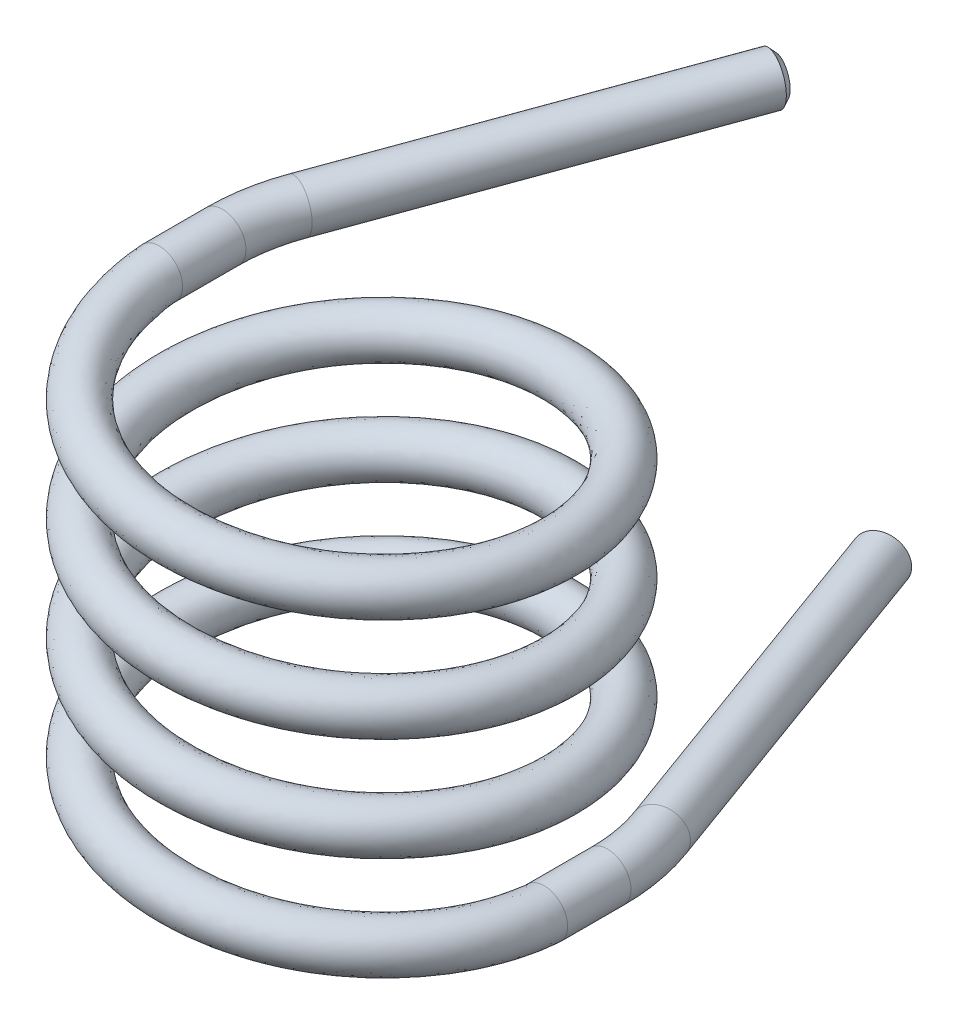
ISO-10303-21;
HEADER;
FILE_DESCRIPTION(('STEP AP214'),'2;1');
FILE_NAME('part.step','',(''),(''),'','','');
FILE_SCHEMA(('AUTOMOTIVE_DESIGN { 1 0 10303 214 1 1 1 1 }'));
ENDSEC;
DATA;
#1=APPLICATION_CONTEXT('core data for automotive mechanical design processes');
#2=APPLICATION_PROTOCOL_DEFINITION('international standard','automotive_design',2000,#1);
#3=PRODUCT_CONTEXT('',#1,'mechanical');
#4=PRODUCT('Part','Part','',(#3));
#5=PRODUCT_RELATED_PRODUCT_CATEGORY('part','',(#4));
#6=PRODUCT_DEFINITION_FORMATION('','',#4);
#7=PRODUCT_DEFINITION_CONTEXT('part definition',#1,'design');
#8=PRODUCT_DEFINITION('design','',#6,#7);
#9=PRODUCT_DEFINITION_SHAPE('','',#8);
#10=(LENGTH_UNIT() NAMED_UNIT(*) SI_UNIT(.MILLI.,.METRE.));
#11=(NAMED_UNIT(*) PLANE_ANGLE_UNIT() SI_UNIT($,.RADIAN.));
#12=(NAMED_UNIT(*) SI_UNIT($,.STERADIAN.) SOLID_ANGLE_UNIT());
#13=UNCERTAINTY_MEASURE_WITH_UNIT(LENGTH_MEASURE(1.E-05),#10,'distance_accuracy_value','');
#14=(GEOMETRIC_REPRESENTATION_CONTEXT(3) GLOBAL_UNCERTAINTY_ASSIGNED_CONTEXT((#13)) GLOBAL_UNIT_ASSIGNED_CONTEXT((#10,
#11,#12)) REPRESENTATION_CONTEXT('',''));
#15=CARTESIAN_POINT('',(0.,0.,0.));
#16=DIRECTION('',(0.,0.,1.));
#17=DIRECTION('',(1.,0.,0.));
#18=AXIS2_PLACEMENT_3D('',#15,#16,#17);
#19=CARTESIAN_POINT('',(-20.4999999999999,0.,-8.56393883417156E-13));
#20=DIRECTION('',(0.,0.,-1.));
#21=DIRECTION('',(-1.,0.,0.));
#22=AXIS2_PLACEMENT_3D('',#19,#20,#21);
#23=PLANE('',#22);
#24=CARTESIAN_POINT('',(-20.4999999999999,0.,-8.56393883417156E-13));
#25=DIRECTION('',(0.,0.,-1.));
#26=DIRECTION('',(-1.,0.,0.));
#27=AXIS2_PLACEMENT_3D('',#24,#25,#26);
#28=CIRCLE('',#27,2.5);
#29=CARTESIAN_POINT('',(-18.0000019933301,-0.00315699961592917,-7.51955688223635E-13));
#30=VERTEX_POINT('',#29);
#31=CARTESIAN_POINT('',(-22.9999999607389,6.58291491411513E-12,-9.6083281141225E-13));
#32=VERTEX_POINT('',#31);
#33=EDGE_CURVE('E177',#30,#32,#28,.T.);
#34=ORIENTED_EDGE('',*,*,#33,.T.);
#35=CARTESIAN_POINT('',(-20.4999999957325,0.000418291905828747,-8.56086035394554E-13));
#36=DIRECTION('',(0.,0.,-1.));
#37=DIRECTION('',(-1.,0.,0.));
#38=AXIS2_PLACEMENT_3D('',#35,#36,#37);
#39=CIRCLE('',#38,2.5);
#40=EDGE_CURVE('E67',#32,#30,#39,.F.);
#41=ORIENTED_EDGE('',*,*,#40,.T.);
#42=EDGE_LOOP('',(#34,#41));
#43=FACE_BOUND('',#42,.T.);
#44=ADVANCED_FACE('F33',(#43),#23,.T.);
#45=CARTESIAN_POINT('',(22.9999999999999,-38.5,-1.82320398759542E-13));
#46=CARTESIAN_POINT('',(23.,-37.8125,9.52691193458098));
#47=CARTESIAN_POINT('',(16.2634559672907,-37.125,16.2634559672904));
#48=CARTESIAN_POINT('',(9.52691193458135,-36.4375,22.9999999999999));
#49=CARTESIAN_POINT('',(1.83728742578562E-13,-35.75,22.9999999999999));
#50=CARTESIAN_POINT('',(-9.52691193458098,-35.0625,23.));
#51=CARTESIAN_POINT('',(-16.2634559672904,-34.375,16.2634559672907));
#52=CARTESIAN_POINT('',(-22.9999999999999,-33.6875,9.52691193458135));
#53=CARTESIAN_POINT('',(-22.9999999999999,-33.,1.85137086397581E-13));
#54=CARTESIAN_POINT('',(-23.,-32.3125,-9.52691193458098));
#55=CARTESIAN_POINT('',(-16.2634559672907,-31.625,-16.2634559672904));
#56=CARTESIAN_POINT('',(-9.52691193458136,-30.9375,-22.9999999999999));
#57=CARTESIAN_POINT('',(-1.865454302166E-13,-30.25,-22.9999999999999));
#58=CARTESIAN_POINT('',(9.52691193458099,-29.5625,-23.));
#59=CARTESIAN_POINT('',(16.2634559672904,-28.875,-16.2634559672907));
#60=CARTESIAN_POINT('',(22.9999999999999,-28.1875,-9.52691193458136));
#61=CARTESIAN_POINT('',(22.9999999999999,-27.5,-1.82320398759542E-13));
#62=CARTESIAN_POINT('',(23.,-26.8125,9.52691193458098));
#63=CARTESIAN_POINT('',(16.2634559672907,-26.125,16.2634559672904));
#64=CARTESIAN_POINT('',(9.52691193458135,-25.4375,22.9999999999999));
#65=CARTESIAN_POINT('',(1.83728742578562E-13,-24.75,22.9999999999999));
#66=CARTESIAN_POINT('',(-9.52691193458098,-24.0625,23.));
#67=CARTESIAN_POINT('',(-16.2634559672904,-23.375,16.2634559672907));
#68=CARTESIAN_POINT('',(-22.9999999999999,-22.6875,9.52691193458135));
#69=CARTESIAN_POINT('',(-22.9999999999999,-22.,1.85137086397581E-13));
#70=CARTESIAN_POINT('',(-23.,-21.3125,-9.52691193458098));
#71=CARTESIAN_POINT('',(-16.2634559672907,-20.625,-16.2634559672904));
#72=CARTESIAN_POINT('',(-9.52691193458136,-19.9375,-22.9999999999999));
#73=CARTESIAN_POINT('',(-1.865454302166E-13,-19.25,-22.9999999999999));
#74=CARTESIAN_POINT('',(9.52691193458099,-18.5625,-23.));
#75=CARTESIAN_POINT('',(16.2634559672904,-17.875,-16.2634559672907));
#76=CARTESIAN_POINT('',(22.9999999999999,-17.1875,-9.52691193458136));
#77=CARTESIAN_POINT('',(22.9999999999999,-16.5,-1.82320398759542E-13));
#78=CARTESIAN_POINT('',(23.,-15.8125,9.52691193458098));
#79=CARTESIAN_POINT('',(16.2634559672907,-15.125,16.2634559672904));
#80=CARTESIAN_POINT('',(9.52691193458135,-14.4375,22.9999999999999));
#81=CARTESIAN_POINT('',(1.83728742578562E-13,-13.75,22.9999999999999));
#82=CARTESIAN_POINT('',(-9.52691193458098,-13.0625,23.));
#83=CARTESIAN_POINT('',(-16.2634559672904,-12.375,16.2634559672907));
#84=CARTESIAN_POINT('',(-22.9999999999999,-11.6875,9.52691193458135));
#85=CARTESIAN_POINT('',(-22.9999999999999,-11.,1.85137086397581E-13));
#86=CARTESIAN_POINT('',(-23.,-10.3125000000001,-9.52691193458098));
#87=CARTESIAN_POINT('',(-16.2634559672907,-9.62500000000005,-16.2634559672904));
#88=CARTESIAN_POINT('',(-9.52691193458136,-8.93750000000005,-22.9999999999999));
#89=CARTESIAN_POINT('',(-1.865454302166E-13,-8.25000000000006,-22.9999999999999));
#90=CARTESIAN_POINT('',(9.52691193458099,-7.56250000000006,-23.));
#91=CARTESIAN_POINT('',(16.2634559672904,-6.87500000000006,-16.2634559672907));
#92=CARTESIAN_POINT('',(22.9999999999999,-6.18750000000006,-9.52691193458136));
#93=CARTESIAN_POINT('',(22.9999999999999,-5.50000000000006,-1.82320398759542E-13));
#94=CARTESIAN_POINT('',(23.,-4.81250000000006,9.52691193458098));
#95=CARTESIAN_POINT('',(16.2634559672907,-4.12500000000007,16.2634559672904));
#96=CARTESIAN_POINT('',(9.52691193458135,-3.43750000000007,22.9999999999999));
#97=CARTESIAN_POINT('',(1.83728742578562E-13,-2.75000000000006,22.9999999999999));
#98=CARTESIAN_POINT('',(-9.52691193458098,-2.06250000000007,23.));
#99=CARTESIAN_POINT('',(-16.2634559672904,-1.37500000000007,16.2634559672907));
#100=CARTESIAN_POINT('',(-22.9999999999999,-0.68750000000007,9.52691193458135));
#101=CARTESIAN_POINT('',(-22.9999999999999,0.,1.85137086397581E-13));
#102=CARTESIAN_POINT('',(-23.,0.687499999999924,-9.52691193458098));
#103=CARTESIAN_POINT('',(-16.2634559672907,1.37499999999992,-16.2634559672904));
#104=CARTESIAN_POINT('',(-9.52691193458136,2.06249999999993,-22.9999999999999));
#105=CARTESIAN_POINT('',(-1.865454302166E-13,2.74999999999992,-22.9999999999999));
#106=CARTESIAN_POINT('',(9.52691193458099,3.43749999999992,-23.));
#107=CARTESIAN_POINT('',(16.2634559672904,4.12499999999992,-16.2634559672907));
#108=CARTESIAN_POINT('',(22.9999999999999,4.81249999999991,-9.52691193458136));
#109=CARTESIAN_POINT('',(22.9999999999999,5.49999999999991,-1.82320398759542E-13));
#110=CARTESIAN_POINT('',(22.9999999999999,-33.5,-1.82320398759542E-13));
#111=CARTESIAN_POINT('',(23.,-32.8125,9.52691193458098));
#112=CARTESIAN_POINT('',(16.2634559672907,-32.125,16.2634559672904));
#113=CARTESIAN_POINT('',(9.52691193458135,-31.4375,22.9999999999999));
#114=CARTESIAN_POINT('',(1.83728742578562E-13,-30.75,22.9999999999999));
#115=CARTESIAN_POINT('',(-9.52691193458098,-30.0625,23.));
#116=CARTESIAN_POINT('',(-16.2634559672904,-29.375,16.2634559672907));
#117=CARTESIAN_POINT('',(-22.9999999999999,-28.6875,9.52691193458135));
#118=CARTESIAN_POINT('',(-22.9999999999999,-28.,1.85137086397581E-13));
#119=CARTESIAN_POINT('',(-23.,-27.3125,-9.52691193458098));
#120=CARTESIAN_POINT('',(-16.2634559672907,-26.625,-16.2634559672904));
#121=CARTESIAN_POINT('',(-9.52691193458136,-25.9375,-22.9999999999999));
#122=CARTESIAN_POINT('',(-1.865454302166E-13,-25.25,-22.9999999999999));
#123=CARTESIAN_POINT('',(9.52691193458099,-24.5625,-23.));
#124=CARTESIAN_POINT('',(16.2634559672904,-23.875,-16.2634559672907));
#125=CARTESIAN_POINT('',(22.9999999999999,-23.1875,-9.52691193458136));
#126=CARTESIAN_POINT('',(22.9999999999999,-22.5,-1.82320398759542E-13));
#127=CARTESIAN_POINT('',(23.,-21.8125,9.52691193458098));
#128=CARTESIAN_POINT('',(16.2634559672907,-21.125,16.2634559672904));
#129=CARTESIAN_POINT('',(9.52691193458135,-20.4375,22.9999999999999));
#130=CARTESIAN_POINT('',(1.83728742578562E-13,-19.75,22.9999999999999));
#131=CARTESIAN_POINT('',(-9.52691193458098,-19.0625,23.));
#132=CARTESIAN_POINT('',(-16.2634559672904,-18.375,16.2634559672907));
#133=CARTESIAN_POINT('',(-22.9999999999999,-17.6875,9.52691193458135));
#134=CARTESIAN_POINT('',(-22.9999999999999,-17.,1.85137086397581E-13));
#135=CARTESIAN_POINT('',(-23.,-16.3125,-9.52691193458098));
#136=CARTESIAN_POINT('',(-16.2634559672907,-15.625,-16.2634559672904));
#137=CARTESIAN_POINT('',(-9.52691193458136,-14.9375,-22.9999999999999));
#138=CARTESIAN_POINT('',(-1.865454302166E-13,-14.25,-22.9999999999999));
#139=CARTESIAN_POINT('',(9.52691193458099,-13.5625,-23.));
#140=CARTESIAN_POINT('',(16.2634559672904,-12.875,-16.2634559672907));
#141=CARTESIAN_POINT('',(22.9999999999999,-12.1875,-9.52691193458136));
#142=CARTESIAN_POINT('',(22.9999999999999,-11.5,-1.82320398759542E-13));
#143=CARTESIAN_POINT('',(23.,-10.8125,9.52691193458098));
#144=CARTESIAN_POINT('',(16.2634559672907,-10.125,16.2634559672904));
#145=CARTESIAN_POINT('',(9.52691193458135,-9.43750000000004,22.9999999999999));
#146=CARTESIAN_POINT('',(1.83728742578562E-13,-8.75000000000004,22.9999999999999));
#147=CARTESIAN_POINT('',(-9.52691193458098,-8.06250000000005,23.));
#148=CARTESIAN_POINT('',(-16.2634559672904,-7.37500000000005,16.2634559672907));
#149=CARTESIAN_POINT('',(-22.9999999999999,-6.68750000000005,9.52691193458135));
#150=CARTESIAN_POINT('',(-22.9999999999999,-6.00000000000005,1.85137086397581E-13));
#151=CARTESIAN_POINT('',(-23.,-5.31250000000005,-9.52691193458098));
#152=CARTESIAN_POINT('',(-16.2634559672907,-4.62500000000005,-16.2634559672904));
#153=CARTESIAN_POINT('',(-9.52691193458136,-3.93750000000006,-22.9999999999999));
#154=CARTESIAN_POINT('',(-1.865454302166E-13,-3.25000000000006,-22.9999999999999));
#155=CARTESIAN_POINT('',(9.52691193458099,-2.56250000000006,-23.));
#156=CARTESIAN_POINT('',(16.2634559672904,-1.87500000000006,-16.2634559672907));
#157=CARTESIAN_POINT('',(22.9999999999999,-1.18750000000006,-9.52691193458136));
#158=CARTESIAN_POINT('',(22.9999999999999,-0.500000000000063,-1.82320398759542E-13));
#159=CARTESIAN_POINT('',(23.,0.187499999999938,9.52691193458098));
#160=CARTESIAN_POINT('',(16.2634559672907,0.874999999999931,16.2634559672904));
#161=CARTESIAN_POINT('',(9.52691193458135,1.56249999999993,22.9999999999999));
#162=CARTESIAN_POINT('',(1.83728742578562E-13,2.24999999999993,22.9999999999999));
#163=CARTESIAN_POINT('',(-9.52691193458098,2.93749999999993,23.));
#164=CARTESIAN_POINT('',(-16.2634559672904,3.62499999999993,16.2634559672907));
#165=CARTESIAN_POINT('',(-22.9999999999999,4.31249999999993,9.52691193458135));
#166=CARTESIAN_POINT('',(-22.9999999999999,4.99999999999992,1.85137086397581E-13));
#167=CARTESIAN_POINT('',(-23.,5.68749999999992,-9.52691193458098));
#168=CARTESIAN_POINT('',(-16.2634559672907,6.37499999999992,-16.2634559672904));
#169=CARTESIAN_POINT('',(-9.52691193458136,7.06249999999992,-22.9999999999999));
#170=CARTESIAN_POINT('',(-1.865454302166E-13,7.74999999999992,-22.9999999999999));
#171=CARTESIAN_POINT('',(9.52691193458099,8.43749999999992,-23.));
#172=CARTESIAN_POINT('',(16.2634559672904,9.12499999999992,-16.2634559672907));
#173=CARTESIAN_POINT('',(22.9999999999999,9.81249999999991,-9.52691193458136));
#174=CARTESIAN_POINT('',(22.9999999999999,10.4999999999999,-1.82320398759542E-13));
#175=CARTESIAN_POINT('',(17.9999999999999,-33.5,-1.42685529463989E-13));
#176=CARTESIAN_POINT('',(18.,-32.8125,7.45584412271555));
#177=CARTESIAN_POINT('',(12.7279220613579,-32.125,12.7279220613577));
#178=CARTESIAN_POINT('',(7.45584412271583,-31.4375,17.9999999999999));
#179=CARTESIAN_POINT('',(1.43787711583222E-13,-30.75,17.9999999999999));
#180=CARTESIAN_POINT('',(-7.45584412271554,-30.0625,18.));
#181=CARTESIAN_POINT('',(-12.7279220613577,-29.375,12.7279220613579));
#182=CARTESIAN_POINT('',(-17.9999999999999,-28.6875,7.45584412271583));
#183=CARTESIAN_POINT('',(-17.9999999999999,-28.,1.44889893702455E-13));
#184=CARTESIAN_POINT('',(-18.,-27.3125,-7.45584412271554));
#185=CARTESIAN_POINT('',(-12.7279220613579,-26.625,-12.7279220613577));
#186=CARTESIAN_POINT('',(-7.45584412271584,-25.9375,-17.9999999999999));
#187=CARTESIAN_POINT('',(-1.45992075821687E-13,-25.25,-17.9999999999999));
#188=CARTESIAN_POINT('',(7.45584412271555,-24.5625,-18.));
#189=CARTESIAN_POINT('',(12.7279220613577,-23.875,-12.7279220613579));
#190=CARTESIAN_POINT('',(17.9999999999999,-23.1875,-7.45584412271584));
#191=CARTESIAN_POINT('',(17.9999999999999,-22.5,-1.42685529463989E-13));
#192=CARTESIAN_POINT('',(18.,-21.8125,7.45584412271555));
#193=CARTESIAN_POINT('',(12.7279220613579,-21.125,12.7279220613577));
#194=CARTESIAN_POINT('',(7.45584412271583,-20.4375,17.9999999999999));
#195=CARTESIAN_POINT('',(1.43787711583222E-13,-19.75,17.9999999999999));
#196=CARTESIAN_POINT('',(-7.45584412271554,-19.0625,18.));
#197=CARTESIAN_POINT('',(-12.7279220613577,-18.375,12.7279220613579));
#198=CARTESIAN_POINT('',(-17.9999999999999,-17.6875,7.45584412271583));
#199=CARTESIAN_POINT('',(-17.9999999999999,-17.,1.44889893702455E-13));
#200=CARTESIAN_POINT('',(-18.,-16.3125,-7.45584412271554));
#201=CARTESIAN_POINT('',(-12.7279220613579,-15.625,-12.7279220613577));
#202=CARTESIAN_POINT('',(-7.45584412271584,-14.9375,-17.9999999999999));
#203=CARTESIAN_POINT('',(-1.45992075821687E-13,-14.25,-17.9999999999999));
#204=CARTESIAN_POINT('',(7.45584412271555,-13.5625,-18.));
#205=CARTESIAN_POINT('',(12.7279220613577,-12.875,-12.7279220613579));
#206=CARTESIAN_POINT('',(17.9999999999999,-12.1875,-7.45584412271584));
#207=CARTESIAN_POINT('',(17.9999999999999,-11.5,-1.42685529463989E-13));
#208=CARTESIAN_POINT('',(18.,-10.8125,7.45584412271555));
#209=CARTESIAN_POINT('',(12.7279220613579,-10.125,12.7279220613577));
#210=CARTESIAN_POINT('',(7.45584412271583,-9.43750000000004,17.9999999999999));
#211=CARTESIAN_POINT('',(1.43787711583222E-13,-8.75000000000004,17.9999999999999));
#212=CARTESIAN_POINT('',(-7.45584412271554,-8.06250000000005,18.));
#213=CARTESIAN_POINT('',(-12.7279220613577,-7.37500000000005,12.7279220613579));
#214=CARTESIAN_POINT('',(-17.9999999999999,-6.68750000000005,7.45584412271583));
#215=CARTESIAN_POINT('',(-17.9999999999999,-6.00000000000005,1.44889893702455E-13));
#216=CARTESIAN_POINT('',(-18.,-5.31250000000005,-7.45584412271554));
#217=CARTESIAN_POINT('',(-12.7279220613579,-4.62500000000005,-12.7279220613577));
#218=CARTESIAN_POINT('',(-7.45584412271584,-3.93750000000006,-17.9999999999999));
#219=CARTESIAN_POINT('',(-1.45992075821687E-13,-3.25000000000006,-17.9999999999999));
#220=CARTESIAN_POINT('',(7.45584412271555,-2.56250000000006,-18.));
#221=CARTESIAN_POINT('',(12.7279220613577,-1.87500000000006,-12.7279220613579));
#222=CARTESIAN_POINT('',(17.9999999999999,-1.18750000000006,-7.45584412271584));
#223=CARTESIAN_POINT('',(17.9999999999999,-0.500000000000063,-1.42685529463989E-13));
#224=CARTESIAN_POINT('',(18.,0.187499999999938,7.45584412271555));
#225=CARTESIAN_POINT('',(12.7279220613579,0.874999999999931,12.7279220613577));
#226=CARTESIAN_POINT('',(7.45584412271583,1.56249999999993,17.9999999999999));
#227=CARTESIAN_POINT('',(1.43787711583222E-13,2.24999999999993,17.9999999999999));
#228=CARTESIAN_POINT('',(-7.45584412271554,2.93749999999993,18.));
#229=CARTESIAN_POINT('',(-12.7279220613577,3.62499999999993,12.7279220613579));
#230=CARTESIAN_POINT('',(-17.9999999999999,4.31249999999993,7.45584412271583));
#231=CARTESIAN_POINT('',(-17.9999999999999,4.99999999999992,1.44889893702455E-13));
#232=CARTESIAN_POINT('',(-18.,5.68749999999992,-7.45584412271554));
#233=CARTESIAN_POINT('',(-12.7279220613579,6.37499999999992,-12.7279220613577));
#234=CARTESIAN_POINT('',(-7.45584412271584,7.06249999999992,-17.9999999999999));
#235=CARTESIAN_POINT('',(-1.45992075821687E-13,7.74999999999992,-17.9999999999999));
#236=CARTESIAN_POINT('',(7.45584412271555,8.43749999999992,-18.));
#237=CARTESIAN_POINT('',(12.7279220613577,9.12499999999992,-12.7279220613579));
#238=CARTESIAN_POINT('',(17.9999999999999,9.81249999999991,-7.45584412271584));
#239=CARTESIAN_POINT('',(17.9999999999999,10.4999999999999,-1.42685529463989E-13));
#240=CARTESIAN_POINT('',(17.9999999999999,-38.5,-1.42685529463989E-13));
#241=CARTESIAN_POINT('',(18.,-37.8125,7.45584412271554));
#242=CARTESIAN_POINT('',(12.7279220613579,-37.125,12.7279220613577));
#243=CARTESIAN_POINT('',(7.45584412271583,-36.4375,17.9999999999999));
#244=CARTESIAN_POINT('',(1.43787711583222E-13,-35.75,17.9999999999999));
#245=CARTESIAN_POINT('',(-7.45584412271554,-35.0625,18.));
#246=CARTESIAN_POINT('',(-12.7279220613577,-34.375,12.7279220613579));
#247=CARTESIAN_POINT('',(-17.9999999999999,-33.6875,7.45584412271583));
#248=CARTESIAN_POINT('',(-17.9999999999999,-33.,1.44889893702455E-13));
#249=CARTESIAN_POINT('',(-18.,-32.3125,-7.45584412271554));
#250=CARTESIAN_POINT('',(-12.7279220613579,-31.625,-12.7279220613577));
#251=CARTESIAN_POINT('',(-7.45584412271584,-30.9375,-17.9999999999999));
#252=CARTESIAN_POINT('',(-1.45992075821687E-13,-30.25,-17.9999999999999));
#253=CARTESIAN_POINT('',(7.45584412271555,-29.5625,-18.));
#254=CARTESIAN_POINT('',(12.7279220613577,-28.875,-12.7279220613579));
#255=CARTESIAN_POINT('',(17.9999999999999,-28.1875,-7.45584412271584));
#256=CARTESIAN_POINT('',(17.9999999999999,-27.5,-1.42685529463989E-13));
#257=CARTESIAN_POINT('',(18.,-26.8125,7.45584412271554));
#258=CARTESIAN_POINT('',(12.7279220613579,-26.125,12.7279220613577));
#259=CARTESIAN_POINT('',(7.45584412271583,-25.4375,17.9999999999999));
#260=CARTESIAN_POINT('',(1.43787711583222E-13,-24.75,17.9999999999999));
#261=CARTESIAN_POINT('',(-7.45584412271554,-24.0625,18.));
#262=CARTESIAN_POINT('',(-12.7279220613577,-23.375,12.7279220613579));
#263=CARTESIAN_POINT('',(-17.9999999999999,-22.6875,7.45584412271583));
#264=CARTESIAN_POINT('',(-17.9999999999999,-22.,1.44889893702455E-13));
#265=CARTESIAN_POINT('',(-18.,-21.3125,-7.45584412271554));
#266=CARTESIAN_POINT('',(-12.7279220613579,-20.625,-12.7279220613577));
#267=CARTESIAN_POINT('',(-7.45584412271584,-19.9375,-17.9999999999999));
#268=CARTESIAN_POINT('',(-1.45992075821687E-13,-19.25,-17.9999999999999));
#269=CARTESIAN_POINT('',(7.45584412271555,-18.5625,-18.));
#270=CARTESIAN_POINT('',(12.7279220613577,-17.875,-12.7279220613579));
#271=CARTESIAN_POINT('',(17.9999999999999,-17.1875,-7.45584412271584));
#272=CARTESIAN_POINT('',(17.9999999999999,-16.5,-1.42685529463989E-13));
#273=CARTESIAN_POINT('',(18.,-15.8125,7.45584412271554));
#274=CARTESIAN_POINT('',(12.7279220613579,-15.125,12.7279220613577));
#275=CARTESIAN_POINT('',(7.45584412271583,-14.4375,17.9999999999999));
#276=CARTESIAN_POINT('',(1.43787711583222E-13,-13.75,17.9999999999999));
#277=CARTESIAN_POINT('',(-7.45584412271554,-13.0625,18.));
#278=CARTESIAN_POINT('',(-12.7279220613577,-12.375,12.7279220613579));
#279=CARTESIAN_POINT('',(-17.9999999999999,-11.6875,7.45584412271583));
#280=CARTESIAN_POINT('',(-17.9999999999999,-11.,1.44889893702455E-13));
#281=CARTESIAN_POINT('',(-18.,-10.3125000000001,-7.45584412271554));
#282=CARTESIAN_POINT('',(-12.7279220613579,-9.62500000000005,-12.7279220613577));
#283=CARTESIAN_POINT('',(-7.45584412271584,-8.93750000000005,-17.9999999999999));
#284=CARTESIAN_POINT('',(-1.45992075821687E-13,-8.25000000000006,-17.9999999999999));
#285=CARTESIAN_POINT('',(7.45584412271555,-7.56250000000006,-18.));
#286=CARTESIAN_POINT('',(12.7279220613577,-6.87500000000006,-12.7279220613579));
#287=CARTESIAN_POINT('',(17.9999999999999,-6.18750000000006,-7.45584412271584));
#288=CARTESIAN_POINT('',(17.9999999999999,-5.50000000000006,-1.42685529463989E-13));
#289=CARTESIAN_POINT('',(18.,-4.81250000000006,7.45584412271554));
#290=CARTESIAN_POINT('',(12.7279220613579,-4.12500000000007,12.7279220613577));
#291=CARTESIAN_POINT('',(7.45584412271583,-3.43750000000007,17.9999999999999));
#292=CARTESIAN_POINT('',(1.43787711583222E-13,-2.75000000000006,17.9999999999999));
#293=CARTESIAN_POINT('',(-7.45584412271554,-2.06250000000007,18.));
#294=CARTESIAN_POINT('',(-12.7279220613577,-1.37500000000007,12.7279220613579));
#295=CARTESIAN_POINT('',(-17.9999999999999,-0.68750000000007,7.45584412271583));
#296=CARTESIAN_POINT('',(-17.9999999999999,0.,1.44889893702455E-13));
#297=CARTESIAN_POINT('',(-18.,0.687499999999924,-7.45584412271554));
#298=CARTESIAN_POINT('',(-12.7279220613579,1.37499999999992,-12.7279220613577));
#299=CARTESIAN_POINT('',(-7.45584412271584,2.06249999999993,-17.9999999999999));
#300=CARTESIAN_POINT('',(-1.45992075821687E-13,2.74999999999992,-17.9999999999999));
#301=CARTESIAN_POINT('',(7.45584412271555,3.43749999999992,-18.));
#302=CARTESIAN_POINT('',(12.7279220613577,4.12499999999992,-12.7279220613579));
#303=CARTESIAN_POINT('',(17.9999999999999,4.81249999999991,-7.45584412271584));
#304=CARTESIAN_POINT('',(17.9999999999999,5.49999999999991,-1.42685529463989E-13));
#305=CARTESIAN_POINT('',(17.9999999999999,-43.5,-1.42685529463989E-13));
#306=CARTESIAN_POINT('',(18.,-42.8125,7.45584412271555));
#307=CARTESIAN_POINT('',(12.7279220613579,-42.125,12.7279220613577));
#308=CARTESIAN_POINT('',(7.45584412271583,-41.4375,17.9999999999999));
#309=CARTESIAN_POINT('',(1.43787711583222E-13,-40.75,17.9999999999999));
#310=CARTESIAN_POINT('',(-7.45584412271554,-40.0625,18.));
#311=CARTESIAN_POINT('',(-12.7279220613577,-39.375,12.7279220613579));
#312=CARTESIAN_POINT('',(-17.9999999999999,-38.6875,7.45584412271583));
#313=CARTESIAN_POINT('',(-17.9999999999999,-38.,1.44889893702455E-13));
#314=CARTESIAN_POINT('',(-18.,-37.3125,-7.45584412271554));
#315=CARTESIAN_POINT('',(-12.7279220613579,-36.625,-12.7279220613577));
#316=CARTESIAN_POINT('',(-7.45584412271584,-35.9375,-17.9999999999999));
#317=CARTESIAN_POINT('',(-1.45992075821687E-13,-35.25,-17.9999999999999));
#318=CARTESIAN_POINT('',(7.45584412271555,-34.5625,-18.));
#319=CARTESIAN_POINT('',(12.7279220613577,-33.875,-12.7279220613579));
#320=CARTESIAN_POINT('',(17.9999999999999,-33.1875,-7.45584412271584));
#321=CARTESIAN_POINT('',(17.9999999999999,-32.5,-1.42685529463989E-13));
#322=CARTESIAN_POINT('',(18.,-31.8125,7.45584412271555));
#323=CARTESIAN_POINT('',(12.7279220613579,-31.125,12.7279220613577));
#324=CARTESIAN_POINT('',(7.45584412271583,-30.4375,17.9999999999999));
#325=CARTESIAN_POINT('',(1.43787711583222E-13,-29.75,17.9999999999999));
#326=CARTESIAN_POINT('',(-7.45584412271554,-29.0625,18.));
#327=CARTESIAN_POINT('',(-12.7279220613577,-28.375,12.7279220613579));
#328=CARTESIAN_POINT('',(-17.9999999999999,-27.6875,7.45584412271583));
#329=CARTESIAN_POINT('',(-17.9999999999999,-27.,1.44889893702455E-13));
#330=CARTESIAN_POINT('',(-18.,-26.3125,-7.45584412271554));
#331=CARTESIAN_POINT('',(-12.7279220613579,-25.625,-12.7279220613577));
#332=CARTESIAN_POINT('',(-7.45584412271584,-24.9375,-17.9999999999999));
#333=CARTESIAN_POINT('',(-1.45992075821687E-13,-24.25,-17.9999999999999));
#334=CARTESIAN_POINT('',(7.45584412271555,-23.5625,-18.));
#335=CARTESIAN_POINT('',(12.7279220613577,-22.875,-12.7279220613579));
#336=CARTESIAN_POINT('',(17.9999999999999,-22.1875,-7.45584412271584));
#337=CARTESIAN_POINT('',(17.9999999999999,-21.5,-1.42685529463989E-13));
#338=CARTESIAN_POINT('',(18.,-20.8125,7.45584412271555));
#339=CARTESIAN_POINT('',(12.7279220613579,-20.125,12.7279220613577));
#340=CARTESIAN_POINT('',(7.45584412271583,-19.4375,17.9999999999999));
#341=CARTESIAN_POINT('',(1.43787711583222E-13,-18.75,17.9999999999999));
#342=CARTESIAN_POINT('',(-7.45584412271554,-18.0625,18.));
#343=CARTESIAN_POINT('',(-12.7279220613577,-17.375,12.7279220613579));
#344=CARTESIAN_POINT('',(-17.9999999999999,-16.6875,7.45584412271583));
#345=CARTESIAN_POINT('',(-17.9999999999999,-16.,1.44889893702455E-13));
#346=CARTESIAN_POINT('',(-18.,-15.3125,-7.45584412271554));
#347=CARTESIAN_POINT('',(-12.7279220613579,-14.625,-12.7279220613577));
#348=CARTESIAN_POINT('',(-7.45584412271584,-13.9375000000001,-17.9999999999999));
#349=CARTESIAN_POINT('',(-1.45992075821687E-13,-13.2500000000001,-17.9999999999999));
#350=CARTESIAN_POINT('',(7.45584412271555,-12.5625000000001,-18.));
#351=CARTESIAN_POINT('',(12.7279220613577,-11.8750000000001,-12.7279220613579));
#352=CARTESIAN_POINT('',(17.9999999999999,-11.1875000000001,-7.45584412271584));
#353=CARTESIAN_POINT('',(17.9999999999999,-10.5000000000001,-1.42685529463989E-13));
#354=CARTESIAN_POINT('',(18.,-9.81250000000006,7.45584412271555));
#355=CARTESIAN_POINT('',(12.7279220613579,-9.12500000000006,12.7279220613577));
#356=CARTESIAN_POINT('',(7.45584412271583,-8.43750000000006,17.9999999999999));
#357=CARTESIAN_POINT('',(1.43787711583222E-13,-7.75000000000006,17.9999999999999));
#358=CARTESIAN_POINT('',(-7.45584412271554,-7.06250000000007,18.));
#359=CARTESIAN_POINT('',(-12.7279220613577,-6.37500000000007,12.7279220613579));
#360=CARTESIAN_POINT('',(-17.9999999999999,-5.68750000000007,7.45584412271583));
#361=CARTESIAN_POINT('',(-17.9999999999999,-5.00000000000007,1.44889893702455E-13));
#362=CARTESIAN_POINT('',(-18.,-4.31250000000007,-7.45584412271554));
#363=CARTESIAN_POINT('',(-12.7279220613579,-3.62500000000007,-12.7279220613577));
#364=CARTESIAN_POINT('',(-7.45584412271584,-2.93750000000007,-17.9999999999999));
#365=CARTESIAN_POINT('',(-1.45992075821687E-13,-2.25000000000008,-17.9999999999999));
#366=CARTESIAN_POINT('',(7.45584412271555,-1.56250000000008,-18.));
#367=CARTESIAN_POINT('',(12.7279220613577,-0.875000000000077,-12.7279220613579));
#368=CARTESIAN_POINT('',(17.9999999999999,-0.187500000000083,-7.45584412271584));
#369=CARTESIAN_POINT('',(17.9999999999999,0.499999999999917,-1.42685529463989E-13));
#370=CARTESIAN_POINT('',(22.9999999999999,-43.5,-1.82320398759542E-13));
#371=CARTESIAN_POINT('',(23.,-42.8125,9.52691193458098));
#372=CARTESIAN_POINT('',(16.2634559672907,-42.125,16.2634559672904));
#373=CARTESIAN_POINT('',(9.52691193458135,-41.4375,22.9999999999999));
#374=CARTESIAN_POINT('',(1.83728742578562E-13,-40.75,22.9999999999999));
#375=CARTESIAN_POINT('',(-9.52691193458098,-40.0625,23.));
#376=CARTESIAN_POINT('',(-16.2634559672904,-39.375,16.2634559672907));
#377=CARTESIAN_POINT('',(-22.9999999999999,-38.6875,9.52691193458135));
#378=CARTESIAN_POINT('',(-22.9999999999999,-38.,1.85137086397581E-13));
#379=CARTESIAN_POINT('',(-23.,-37.3125,-9.52691193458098));
#380=CARTESIAN_POINT('',(-16.2634559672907,-36.625,-16.2634559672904));
#381=CARTESIAN_POINT('',(-9.52691193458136,-35.9375,-22.9999999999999));
#382=CARTESIAN_POINT('',(-1.865454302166E-13,-35.25,-22.9999999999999));
#383=CARTESIAN_POINT('',(9.52691193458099,-34.5625,-23.));
#384=CARTESIAN_POINT('',(16.2634559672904,-33.875,-16.2634559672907));
#385=CARTESIAN_POINT('',(22.9999999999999,-33.1875,-9.52691193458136));
#386=CARTESIAN_POINT('',(22.9999999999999,-32.5,-1.82320398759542E-13));
#387=CARTESIAN_POINT('',(23.,-31.8125,9.52691193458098));
#388=CARTESIAN_POINT('',(16.2634559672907,-31.125,16.2634559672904));
#389=CARTESIAN_POINT('',(9.52691193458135,-30.4375,22.9999999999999));
#390=CARTESIAN_POINT('',(1.83728742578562E-13,-29.75,22.9999999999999));
#391=CARTESIAN_POINT('',(-9.52691193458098,-29.0625,23.));
#392=CARTESIAN_POINT('',(-16.2634559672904,-28.375,16.2634559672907));
#393=CARTESIAN_POINT('',(-22.9999999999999,-27.6875,9.52691193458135));
#394=CARTESIAN_POINT('',(-22.9999999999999,-27.,1.85137086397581E-13));
#395=CARTESIAN_POINT('',(-23.,-26.3125,-9.52691193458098));
#396=CARTESIAN_POINT('',(-16.2634559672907,-25.625,-16.2634559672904));
#397=CARTESIAN_POINT('',(-9.52691193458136,-24.9375,-22.9999999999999));
#398=CARTESIAN_POINT('',(-1.865454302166E-13,-24.25,-22.9999999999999));
#399=CARTESIAN_POINT('',(9.52691193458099,-23.5625,-23.));
#400=CARTESIAN_POINT('',(16.2634559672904,-22.875,-16.2634559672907));
#401=CARTESIAN_POINT('',(22.9999999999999,-22.1875,-9.52691193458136));
#402=CARTESIAN_POINT('',(22.9999999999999,-21.5,-1.82320398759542E-13));
#403=CARTESIAN_POINT('',(23.,-20.8125,9.52691193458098));
#404=CARTESIAN_POINT('',(16.2634559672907,-20.125,16.2634559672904));
#405=CARTESIAN_POINT('',(9.52691193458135,-19.4375,22.9999999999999));
#406=CARTESIAN_POINT('',(1.83728742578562E-13,-18.75,22.9999999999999));
#407=CARTESIAN_POINT('',(-9.52691193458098,-18.0625,23.));
#408=CARTESIAN_POINT('',(-16.2634559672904,-17.375,16.2634559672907));
#409=CARTESIAN_POINT('',(-22.9999999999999,-16.6875,9.52691193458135));
#410=CARTESIAN_POINT('',(-22.9999999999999,-16.,1.85137086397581E-13));
#411=CARTESIAN_POINT('',(-23.,-15.3125,-9.52691193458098));
#412=CARTESIAN_POINT('',(-16.2634559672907,-14.625,-16.2634559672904));
#413=CARTESIAN_POINT('',(-9.52691193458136,-13.9375000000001,-22.9999999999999));
#414=CARTESIAN_POINT('',(-1.865454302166E-13,-13.2500000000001,-22.9999999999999));
#415=CARTESIAN_POINT('',(9.52691193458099,-12.5625000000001,-23.));
#416=CARTESIAN_POINT('',(16.2634559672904,-11.8750000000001,-16.2634559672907));
#417=CARTESIAN_POINT('',(22.9999999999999,-11.1875000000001,-9.52691193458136));
#418=CARTESIAN_POINT('',(22.9999999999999,-10.5000000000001,-1.82320398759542E-13));
#419=CARTESIAN_POINT('',(23.,-9.81250000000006,9.52691193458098));
#420=CARTESIAN_POINT('',(16.2634559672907,-9.12500000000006,16.2634559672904));
#421=CARTESIAN_POINT('',(9.52691193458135,-8.43750000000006,22.9999999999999));
#422=CARTESIAN_POINT('',(1.83728742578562E-13,-7.75000000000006,22.9999999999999));
#423=CARTESIAN_POINT('',(-9.52691193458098,-7.06250000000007,23.));
#424=CARTESIAN_POINT('',(-16.2634559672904,-6.37500000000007,16.2634559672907));
#425=CARTESIAN_POINT('',(-22.9999999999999,-5.68750000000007,9.52691193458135));
#426=CARTESIAN_POINT('',(-22.9999999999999,-5.00000000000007,1.85137086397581E-13));
#427=CARTESIAN_POINT('',(-23.,-4.31250000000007,-9.52691193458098));
#428=CARTESIAN_POINT('',(-16.2634559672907,-3.62500000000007,-16.2634559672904));
#429=CARTESIAN_POINT('',(-9.52691193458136,-2.93750000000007,-22.9999999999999));
#430=CARTESIAN_POINT('',(-1.865454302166E-13,-2.25000000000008,-22.9999999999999));
#431=CARTESIAN_POINT('',(9.52691193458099,-1.56250000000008,-23.));
#432=CARTESIAN_POINT('',(16.2634559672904,-0.875000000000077,-16.2634559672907));
#433=CARTESIAN_POINT('',(22.9999999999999,-0.187500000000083,-9.52691193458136));
#434=CARTESIAN_POINT('',(22.9999999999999,0.499999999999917,-1.82320398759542E-13));
#435=CARTESIAN_POINT('',(22.9999999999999,-38.5,-1.82320398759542E-13));
#436=CARTESIAN_POINT('',(23.,-37.8125,9.52691193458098));
#437=CARTESIAN_POINT('',(16.2634559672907,-37.125,16.2634559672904));
#438=CARTESIAN_POINT('',(9.52691193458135,-36.4375,22.9999999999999));
#439=CARTESIAN_POINT('',(1.83728742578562E-13,-35.75,22.9999999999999));
#440=CARTESIAN_POINT('',(-9.52691193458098,-35.0625,23.));
#441=CARTESIAN_POINT('',(-16.2634559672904,-34.375,16.2634559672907));
#442=CARTESIAN_POINT('',(-22.9999999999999,-33.6875,9.52691193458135));
#443=CARTESIAN_POINT('',(-22.9999999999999,-33.,1.85137086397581E-13));
#444=CARTESIAN_POINT('',(-23.,-32.3125,-9.52691193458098));
#445=CARTESIAN_POINT('',(-16.2634559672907,-31.625,-16.2634559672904));
#446=CARTESIAN_POINT('',(-9.52691193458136,-30.9375,-22.9999999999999));
#447=CARTESIAN_POINT('',(-1.865454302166E-13,-30.25,-22.9999999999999));
#448=CARTESIAN_POINT('',(9.52691193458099,-29.5625,-23.));
#449=CARTESIAN_POINT('',(16.2634559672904,-28.875,-16.2634559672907));
#450=CARTESIAN_POINT('',(22.9999999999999,-28.1875,-9.52691193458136));
#451=CARTESIAN_POINT('',(22.9999999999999,-27.5,-1.82320398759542E-13));
#452=CARTESIAN_POINT('',(23.,-26.8125,9.52691193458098));
#453=CARTESIAN_POINT('',(16.2634559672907,-26.125,16.2634559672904));
#454=CARTESIAN_POINT('',(9.52691193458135,-25.4375,22.9999999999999));
#455=CARTESIAN_POINT('',(1.83728742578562E-13,-24.75,22.9999999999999));
#456=CARTESIAN_POINT('',(-9.52691193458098,-24.0625,23.));
#457=CARTESIAN_POINT('',(-16.2634559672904,-23.375,16.2634559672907));
#458=CARTESIAN_POINT('',(-22.9999999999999,-22.6875,9.52691193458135));
#459=CARTESIAN_POINT('',(-22.9999999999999,-22.,1.85137086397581E-13));
#460=CARTESIAN_POINT('',(-23.,-21.3125,-9.52691193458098));
#461=CARTESIAN_POINT('',(-16.2634559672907,-20.625,-16.2634559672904));
#462=CARTESIAN_POINT('',(-9.52691193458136,-19.9375,-22.9999999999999));
#463=CARTESIAN_POINT('',(-1.865454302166E-13,-19.25,-22.9999999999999));
#464=CARTESIAN_POINT('',(9.52691193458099,-18.5625,-23.));
#465=CARTESIAN_POINT('',(16.2634559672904,-17.875,-16.2634559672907));
#466=CARTESIAN_POINT('',(22.9999999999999,-17.1875,-9.52691193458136));
#467=CARTESIAN_POINT('',(22.9999999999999,-16.5,-1.82320398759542E-13));
#468=CARTESIAN_POINT('',(23.,-15.8125,9.52691193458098));
#469=CARTESIAN_POINT('',(16.2634559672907,-15.125,16.2634559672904));
#470=CARTESIAN_POINT('',(9.52691193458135,-14.4375,22.9999999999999));
#471=CARTESIAN_POINT('',(1.83728742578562E-13,-13.75,22.9999999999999));
#472=CARTESIAN_POINT('',(-9.52691193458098,-13.0625,23.));
#473=CARTESIAN_POINT('',(-16.2634559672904,-12.375,16.2634559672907));
#474=CARTESIAN_POINT('',(-22.9999999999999,-11.6875,9.52691193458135));
#475=CARTESIAN_POINT('',(-22.9999999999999,-11.,1.85137086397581E-13));
#476=CARTESIAN_POINT('',(-23.,-10.3125000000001,-9.52691193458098));
#477=CARTESIAN_POINT('',(-16.2634559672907,-9.62500000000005,-16.2634559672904));
#478=CARTESIAN_POINT('',(-9.52691193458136,-8.93750000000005,-22.9999999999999));
#479=CARTESIAN_POINT('',(-1.865454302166E-13,-8.25000000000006,-22.9999999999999));
#480=CARTESIAN_POINT('',(9.52691193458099,-7.56250000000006,-23.));
#481=CARTESIAN_POINT('',(16.2634559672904,-6.87500000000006,-16.2634559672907));
#482=CARTESIAN_POINT('',(22.9999999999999,-6.18750000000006,-9.52691193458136));
#483=CARTESIAN_POINT('',(22.9999999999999,-5.50000000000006,-1.82320398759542E-13));
#484=CARTESIAN_POINT('',(23.,-4.81250000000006,9.52691193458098));
#485=CARTESIAN_POINT('',(16.2634559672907,-4.12500000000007,16.2634559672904));
#486=CARTESIAN_POINT('',(9.52691193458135,-3.43750000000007,22.9999999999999));
#487=CARTESIAN_POINT('',(1.83728742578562E-13,-2.75000000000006,22.9999999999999));
#488=CARTESIAN_POINT('',(-9.52691193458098,-2.06250000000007,23.));
#489=CARTESIAN_POINT('',(-16.2634559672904,-1.37500000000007,16.2634559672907));
#490=CARTESIAN_POINT('',(-22.9999999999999,-0.68750000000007,9.52691193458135));
#491=CARTESIAN_POINT('',(-22.9999999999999,0.,1.85137086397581E-13));
#492=CARTESIAN_POINT('',(-23.,0.687499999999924,-9.52691193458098));
#493=CARTESIAN_POINT('',(-16.2634559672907,1.37499999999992,-16.2634559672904));
#494=CARTESIAN_POINT('',(-9.52691193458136,2.06249999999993,-22.9999999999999));
#495=CARTESIAN_POINT('',(-1.865454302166E-13,2.74999999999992,-22.9999999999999));
#496=CARTESIAN_POINT('',(9.52691193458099,3.43749999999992,-23.));
#497=CARTESIAN_POINT('',(16.2634559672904,4.12499999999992,-16.2634559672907));
#498=CARTESIAN_POINT('',(22.9999999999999,4.81249999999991,-9.52691193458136));
#499=CARTESIAN_POINT('',(22.9999999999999,5.49999999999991,-1.82320398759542E-13));
#500=(BOUNDED_SURFACE() B_SPLINE_SURFACE(3,2,((#45,#46,#47,#48,#49,#50,#51,#52,#53,#54,#55,#56,
#57,#58,#59,#60,#61,#62,#63,#64,#65,#66,#67,#68,#69,#70,#71,#72,#73,#74,#75,#76,#77,#78,#79,#80,
#81,#82,#83,#84,#85,#86,#87,#88,#89,#90,#91,#92,#93,#94,#95,#96,#97,#98,#99,#100,#101,#102,#103,
#104,#105,#106,#107,#108,#109),(#110,#111,#112,#113,#114,#115,#116,#117,#118,#119,#120,#121,
#122,#123,#124,#125,#126,#127,#128,#129,#130,#131,#132,#133,#134,#135,#136,#137,#138,#139,#140,
#141,#142,#143,#144,#145,#146,#147,#148,#149,#150,#151,#152,#153,#154,#155,#156,#157,#158,#159,
#160,#161,#162,#163,#164,#165,#166,#167,#168,#169,#170,#171,#172,#173,#174),(#175,#176,#177,
#178,#179,#180,#181,#182,#183,#184,#185,#186,#187,#188,#189,#190,#191,#192,#193,#194,#195,#196,
#197,#198,#199,#200,#201,#202,#203,#204,#205,#206,#207,#208,#209,#210,#211,#212,#213,#214,#215,
#216,#217,#218,#219,#220,#221,#222,#223,#224,#225,#226,#227,#228,#229,#230,#231,#232,#233,#234,
#235,#236,#237,#238,#239),(#240,#241,#242,#243,#244,#245,#246,#247,#248,#249,#250,#251,#252,
#253,#254,#255,#256,#257,#258,#259,#260,#261,#262,#263,#264,#265,#266,#267,#268,#269,#270,#271,
#272,#273,#274,#275,#276,#277,#278,#279,#280,#281,#282,#283,#284,#285,#286,#287,#288,#289,#290,
#291,#292,#293,#294,#295,#296,#297,#298,#299,#300,#301,#302,#303,#304),(#305,#306,#307,#308,
#309,#310,#311,#312,#313,#314,#315,#316,#317,#318,#319,#320,#321,#322,#323,#324,#325,#326,#327,
#328,#329,#330,#331,#332,#333,#334,#335,#336,#337,#338,#339,#340,#341,#342,#343,#344,#345,#346,
#347,#348,#349,#350,#351,#352,#353,#354,#355,#356,#357,#358,#359,#360,#361,#362,#363,#364,#365,
#366,#367,#368,#369),(#370,#371,#372,#373,#374,#375,#376,#377,#378,#379,#380,#381,#382,#383,
#384,#385,#386,#387,#388,#389,#390,#391,#392,#393,#394,#395,#396,#397,#398,#399,#400,#401,#402,
#403,#404,#405,#406,#407,#408,#409,#410,#411,#412,#413,#414,#415,#416,#417,#418,#419,#420,#421,
#422,#423,#424,#425,#426,#427,#428,#429,#430,#431,#432,#433,#434),(#435,#436,#437,#438,#439,
#440,#441,#442,#443,#444,#445,#446,#447,#448,#449,#450,#451,#452,#453,#454,#455,#456,#457,#458,
#459,#460,#461,#462,#463,#464,#465,#466,#467,#468,#469,#470,#471,#472,#473,#474,#475,#476,#477,
#478,#479,#480,#481,#482,#483,#484,#485,#486,#487,#488,#489,#490,#491,#492,#493,#494,#495,#496,
#497,#498,#499)),.UNSPECIFIED.,.T.,.F.,.F.) B_SPLINE_SURFACE_WITH_KNOTS((4,3,4),(3,2,2,2,2,2,2,
2,2,2,2,2,2,2,2,2,2,2,2,2,2,2,2,2,2,2,2,2,2,2,2,2,3),(0.,0.5,1.),(0.,0.03125,0.0625,0.09375,
0.125,0.15625,0.1875,0.21875,0.25,0.28125,0.3125,0.34375,0.375,0.40625,0.4375,0.46875,0.5,
0.53125,0.5625,0.59375,0.625,0.65625,0.6875,0.71875,0.75,0.78125,0.8125,0.84375,0.875,0.90625,
0.9375,0.96875,1.),
.UNSPECIFIED.) GEOMETRIC_REPRESENTATION_ITEM() RATIONAL_B_SPLINE_SURFACE(((1.,0.923879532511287,
1.,0.923879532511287,1.,0.923879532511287,1.,0.923879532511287,1.,0.923879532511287,1.,
0.923879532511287,1.,0.923879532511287,1.,0.923879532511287,1.,0.923879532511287,1.,
0.923879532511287,1.,0.923879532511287,1.,0.923879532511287,1.,0.923879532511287,1.,
0.923879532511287,1.,0.923879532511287,1.,0.923879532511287,1.,0.923879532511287,1.,
0.923879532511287,1.,0.923879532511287,1.,0.923879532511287,1.,0.923879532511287,1.,
0.923879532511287,1.,0.923879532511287,1.,0.923879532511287,1.,0.923879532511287,1.,
0.923879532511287,1.,0.923879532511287,1.,0.923879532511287,1.,0.923879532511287,1.,
0.923879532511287,1.,0.923879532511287,1.,0.923879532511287,1.),(0.333333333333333,
0.307959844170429,0.333333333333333,0.307959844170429,0.333333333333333,0.307959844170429,
0.333333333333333,0.307959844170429,0.333333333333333,0.307959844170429,0.333333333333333,
0.307959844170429,0.333333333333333,0.307959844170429,0.333333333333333,0.307959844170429,
0.333333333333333,0.307959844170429,0.333333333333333,0.307959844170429,0.333333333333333,
0.307959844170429,0.333333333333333,0.307959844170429,0.333333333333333,0.307959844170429,
0.333333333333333,0.307959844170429,0.333333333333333,0.307959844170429,0.333333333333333,
0.307959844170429,0.333333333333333,0.307959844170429,0.333333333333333,0.307959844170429,
0.333333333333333,0.307959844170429,0.333333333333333,0.307959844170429,0.333333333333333,
0.307959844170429,0.333333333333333,0.307959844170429,0.333333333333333,0.307959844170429,
0.333333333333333,0.307959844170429,0.333333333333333,0.307959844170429,0.333333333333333,
0.307959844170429,0.333333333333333,0.307959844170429,0.333333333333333,0.307959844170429,
0.333333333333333,0.307959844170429,0.333333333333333,0.307959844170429,0.333333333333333,
0.307959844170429,0.333333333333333,0.307959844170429,0.333333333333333),(0.333333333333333,
0.307959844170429,0.333333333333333,0.307959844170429,0.333333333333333,0.307959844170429,
0.333333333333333,0.307959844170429,0.333333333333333,0.307959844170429,0.333333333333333,
0.307959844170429,0.333333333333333,0.307959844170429,0.333333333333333,0.307959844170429,
0.333333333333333,0.307959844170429,0.333333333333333,0.307959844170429,0.333333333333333,
0.307959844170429,0.333333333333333,0.307959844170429,0.333333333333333,0.307959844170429,
0.333333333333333,0.307959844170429,0.333333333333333,0.307959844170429,0.333333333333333,
0.307959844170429,0.333333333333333,0.307959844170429,0.333333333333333,0.307959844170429,
0.333333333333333,0.307959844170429,0.333333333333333,0.307959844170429,0.333333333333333,
0.307959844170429,0.333333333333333,0.307959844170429,0.333333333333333,0.307959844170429,
0.333333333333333,0.307959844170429,0.333333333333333,0.307959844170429,0.333333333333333,
0.307959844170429,0.333333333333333,0.307959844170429,0.333333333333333,0.307959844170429,
0.333333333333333,0.307959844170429,0.333333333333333,0.307959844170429,0.333333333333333,
0.307959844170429,0.333333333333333,0.307959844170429,0.333333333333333),(1.,0.923879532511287,
1.,0.923879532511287,1.,0.923879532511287,1.,0.923879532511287,1.,0.923879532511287,1.,
0.923879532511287,1.,0.923879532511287,1.,0.923879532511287,1.,0.923879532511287,1.,
0.923879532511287,1.,0.923879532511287,1.,0.923879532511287,1.,0.923879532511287,1.,
0.923879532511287,1.,0.923879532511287,1.,0.923879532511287,1.,0.923879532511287,1.,
0.923879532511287,1.,0.923879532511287,1.,0.923879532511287,1.,0.923879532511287,1.,
0.923879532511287,1.,0.923879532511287,1.,0.923879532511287,1.,0.923879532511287,1.,
0.923879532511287,1.,0.923879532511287,1.,0.923879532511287,1.,0.923879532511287,1.,
0.923879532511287,1.,0.923879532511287,1.,0.923879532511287,1.),(0.333333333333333,
0.307959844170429,0.333333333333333,0.307959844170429,0.333333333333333,0.307959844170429,
0.333333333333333,0.307959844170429,0.333333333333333,0.307959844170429,0.333333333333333,
0.307959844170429,0.333333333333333,0.307959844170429,0.333333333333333,0.307959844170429,
0.333333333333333,0.307959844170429,0.333333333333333,0.307959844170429,0.333333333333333,
0.307959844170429,0.333333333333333,0.307959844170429,0.333333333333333,0.307959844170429,
0.333333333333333,0.307959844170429,0.333333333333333,0.307959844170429,0.333333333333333,
0.307959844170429,0.333333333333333,0.307959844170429,0.333333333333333,0.307959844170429,
0.333333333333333,0.307959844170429,0.333333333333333,0.307959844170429,0.333333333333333,
0.307959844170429,0.333333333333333,0.307959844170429,0.333333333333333,0.307959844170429,
0.333333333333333,0.307959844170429,0.333333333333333,0.307959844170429,0.333333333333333,
0.307959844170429,0.333333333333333,0.307959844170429,0.333333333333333,0.307959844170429,
0.333333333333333,0.307959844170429,0.333333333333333,0.307959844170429,0.333333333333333,
0.307959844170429,0.333333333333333,0.307959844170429,0.333333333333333),(0.333333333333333,
0.307959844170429,0.333333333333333,0.307959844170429,0.333333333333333,0.307959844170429,
0.333333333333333,0.307959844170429,0.333333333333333,0.307959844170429,0.333333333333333,
0.307959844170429,0.333333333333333,0.307959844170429,0.333333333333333,0.307959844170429,
0.333333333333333,0.307959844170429,0.333333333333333,0.307959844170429,0.333333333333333,
0.307959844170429,0.333333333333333,0.307959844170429,0.333333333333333,0.307959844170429,
0.333333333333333,0.307959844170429,0.333333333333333,0.307959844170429,0.333333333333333,
0.307959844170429,0.333333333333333,0.307959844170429,0.333333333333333,0.307959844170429,
0.333333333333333,0.307959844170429,0.333333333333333,0.307959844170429,0.333333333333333,
0.307959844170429,0.333333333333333,0.307959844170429,0.333333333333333,0.307959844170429,
0.333333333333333,0.307959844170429,0.333333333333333,0.307959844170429,0.333333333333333,
0.307959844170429,0.333333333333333,0.307959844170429,0.333333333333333,0.307959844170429,
0.333333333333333,0.307959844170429,0.333333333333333,0.307959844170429,0.333333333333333,
0.307959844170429,0.333333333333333,0.307959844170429,0.333333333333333),(1.,0.923879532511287,
1.,0.923879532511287,1.,0.923879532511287,1.,0.923879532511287,1.,0.923879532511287,1.,
0.923879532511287,1.,0.923879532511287,1.,0.923879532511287,1.,0.923879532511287,1.,
0.923879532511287,1.,0.923879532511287,1.,0.923879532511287,1.,0.923879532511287,1.,
0.923879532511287,1.,0.923879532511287,1.,0.923879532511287,1.,0.923879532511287,1.,
0.923879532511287,1.,0.923879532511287,1.,0.923879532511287,1.,0.923879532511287,1.,
0.923879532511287,1.,0.923879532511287,1.,0.923879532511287,1.,0.923879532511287,1.,
0.923879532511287,1.,0.923879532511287,1.,0.923879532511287,1.,0.923879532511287,1.,
0.923879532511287,1.,0.923879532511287,1.,0.923879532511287,1.))) REPRESENTATION_ITEM('') SURFACE());
#501=CARTESIAN_POINT('',(-22.9999966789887,0.00449060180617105,-9.60832674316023E-13));
#502=VERTEX_POINT('',#501);
#503=EDGE_CURVE('E62',#32,#502,#28,.T.);
#504=CARTESIAN_POINT('',(-18.0000000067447,0.000183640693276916,-7.51956114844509E-13));
#505=VERTEX_POINT('',#504);
#506=EDGE_CURVE('E48',#505,#30,#28,.T.);
#507=EDGE_CURVE('E65',#502,#505,#28,.T.);
#508=CARTESIAN_POINT('',(20.4999999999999,-38.5,0.));
#509=DIRECTION('',(0.,0.,1.));
#510=DIRECTION('',(1.,0.,0.));
#511=AXIS2_PLACEMENT_3D('',#508,#509,#510);
#512=CIRCLE('',#511,2.5);
#513=CARTESIAN_POINT('',(22.9999999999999,-38.5,0.));
#514=VERTEX_POINT('',#513);
#515=EDGE_CURVE('E180',#514,#514,#512,.T.);
#516=ORIENTED_EDGE('',*,*,#503,.F.);
#517=ORIENTED_EDGE('',*,*,#33,.F.);
#518=ORIENTED_EDGE('',*,*,#506,.F.);
#519=ORIENTED_EDGE('',*,*,#507,.F.);
#520=EDGE_LOOP('',(#516,#517,#518,#519));
#521=FACE_BOUND('',#520,.T.);
#522=ORIENTED_EDGE('',*,*,#515,.T.);
#523=EDGE_LOOP('',(#522));
#524=FACE_BOUND('',#523,.T.);
#525=ADVANCED_FACE('F74',(#521,#524),#500,.T.);
#526=CARTESIAN_POINT('',(-20.4999999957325,0.000418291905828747,-8.56086035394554E-13));
#527=DIRECTION('',(0.,0.,-1.));
#528=DIRECTION('',(-1.,0.,0.));
#529=AXIS2_PLACEMENT_3D('',#526,#527,#528);
#530=CIRCLE('',#529,1.02052702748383);
#531=CARTESIAN_POINT('',(-21.5205270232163,0.000418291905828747,-8.98718869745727E-13));
#532=VERTEX_POINT('',#531);
#533=EDGE_CURVE('E79',#532,#532,#530,.F.);
#534=ORIENTED_EDGE('',*,*,#533,.F.);
#535=EDGE_LOOP('',(#534));
#536=FACE_BOUND('',#535,.T.);
#537=CARTESIAN_POINT('',(-20.4999999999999,0.,-8.56393883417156E-13));
#538=DIRECTION('',(0.,0.,-1.));
#539=DIRECTION('',(-1.,0.,0.));
#540=AXIS2_PLACEMENT_3D('',#537,#538,#539);
#541=CIRCLE('',#540,1.);
#542=CARTESIAN_POINT('',(-21.4999999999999,0.,-8.98169194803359E-13));
#543=VERTEX_POINT('',#542);
#544=EDGE_CURVE('E54',#543,#543,#541,.F.);
#545=ORIENTED_EDGE('',*,*,#544,.T.);
#546=EDGE_LOOP('',(#545));
#547=FACE_BOUND('',#546,.T.);
#548=ADVANCED_FACE('F96',(#536,#547),#23,.T.);
#549=CARTESIAN_POINT('',(21.4999999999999,-38.5,-1.70429937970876E-13));
#550=CARTESIAN_POINT('',(21.5,-37.8125,8.90559159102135));
#551=CARTESIAN_POINT('',(15.2027957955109,-37.125,15.2027957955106));
#552=CARTESIAN_POINT('',(8.90559159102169,-36.4375,21.4999999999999));
#553=CARTESIAN_POINT('',(1.7174643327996E-13,-35.75,21.4999999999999));
#554=CARTESIAN_POINT('',(-8.90559159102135,-35.0625,21.5));
#555=CARTESIAN_POINT('',(-15.2027957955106,-34.375,15.2027957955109));
#556=CARTESIAN_POINT('',(-21.4999999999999,-33.6875,8.90559159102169));
#557=CARTESIAN_POINT('',(-21.4999999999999,-33.,1.73062928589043E-13));
#558=CARTESIAN_POINT('',(-21.5,-32.3125,-8.90559159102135));
#559=CARTESIAN_POINT('',(-15.2027957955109,-31.625,-15.2027957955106));
#560=CARTESIAN_POINT('',(-8.9055915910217,-30.9375,-21.4999999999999));
#561=CARTESIAN_POINT('',(-1.74379423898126E-13,-30.25,-21.4999999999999));
#562=CARTESIAN_POINT('',(8.90559159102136,-29.5625,-21.5));
#563=CARTESIAN_POINT('',(15.2027957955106,-28.875,-15.2027957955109));
#564=CARTESIAN_POINT('',(21.4999999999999,-28.1875,-8.9055915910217));
#565=CARTESIAN_POINT('',(21.4999999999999,-27.5,-1.70429937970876E-13));
#566=CARTESIAN_POINT('',(21.5,-26.8125,8.90559159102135));
#567=CARTESIAN_POINT('',(15.2027957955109,-26.125,15.2027957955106));
#568=CARTESIAN_POINT('',(8.90559159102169,-25.4375,21.4999999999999));
#569=CARTESIAN_POINT('',(1.7174643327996E-13,-24.75,21.4999999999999));
#570=CARTESIAN_POINT('',(-8.90559159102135,-24.0625,21.5));
#571=CARTESIAN_POINT('',(-15.2027957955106,-23.375,15.2027957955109));
#572=CARTESIAN_POINT('',(-21.4999999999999,-22.6875,8.90559159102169));
#573=CARTESIAN_POINT('',(-21.4999999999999,-22.,1.73062928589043E-13));
#574=CARTESIAN_POINT('',(-21.5,-21.3125,-8.90559159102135));
#575=CARTESIAN_POINT('',(-15.2027957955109,-20.625,-15.2027957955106));
#576=CARTESIAN_POINT('',(-8.9055915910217,-19.9375,-21.4999999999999));
#577=CARTESIAN_POINT('',(-1.74379423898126E-13,-19.25,-21.4999999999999));
#578=CARTESIAN_POINT('',(8.90559159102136,-18.5625,-21.5));
#579=CARTESIAN_POINT('',(15.2027957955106,-17.875,-15.2027957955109));
#580=CARTESIAN_POINT('',(21.4999999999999,-17.1875,-8.9055915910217));
#581=CARTESIAN_POINT('',(21.4999999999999,-16.5,-1.70429937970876E-13));
#582=CARTESIAN_POINT('',(21.5,-15.8125,8.90559159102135));
#583=CARTESIAN_POINT('',(15.2027957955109,-15.125,15.2027957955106));
#584=CARTESIAN_POINT('',(8.90559159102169,-14.4375,21.4999999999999));
#585=CARTESIAN_POINT('',(1.7174643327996E-13,-13.75,21.4999999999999));
#586=CARTESIAN_POINT('',(-8.90559159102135,-13.0625,21.5));
#587=CARTESIAN_POINT('',(-15.2027957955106,-12.375,15.2027957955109));
#588=CARTESIAN_POINT('',(-21.4999999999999,-11.6875,8.90559159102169));
#589=CARTESIAN_POINT('',(-21.4999999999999,-11.,1.73062928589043E-13));
#590=CARTESIAN_POINT('',(-21.5,-10.3125000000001,-8.90559159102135));
#591=CARTESIAN_POINT('',(-15.2027957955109,-9.62500000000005,-15.2027957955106));
#592=CARTESIAN_POINT('',(-8.9055915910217,-8.93750000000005,-21.4999999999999));
#593=CARTESIAN_POINT('',(-1.74379423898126E-13,-8.25000000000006,-21.4999999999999));
#594=CARTESIAN_POINT('',(8.90559159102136,-7.56250000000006,-21.5));
#595=CARTESIAN_POINT('',(15.2027957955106,-6.87500000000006,-15.2027957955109));
#596=CARTESIAN_POINT('',(21.4999999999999,-6.18750000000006,-8.9055915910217));
#597=CARTESIAN_POINT('',(21.4999999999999,-5.50000000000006,-1.70429937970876E-13));
#598=CARTESIAN_POINT('',(21.5,-4.81250000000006,8.90559159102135));
#599=CARTESIAN_POINT('',(15.2027957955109,-4.12500000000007,15.2027957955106));
#600=CARTESIAN_POINT('',(8.90559159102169,-3.43750000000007,21.4999999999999));
#601=CARTESIAN_POINT('',(1.7174643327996E-13,-2.75000000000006,21.4999999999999));
#602=CARTESIAN_POINT('',(-8.90559159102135,-2.06250000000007,21.5));
#603=CARTESIAN_POINT('',(-15.2027957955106,-1.37500000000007,15.2027957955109));
#604=CARTESIAN_POINT('',(-21.4999999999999,-0.68750000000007,8.90559159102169));
#605=CARTESIAN_POINT('',(-21.4999999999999,0.,1.73062928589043E-13));
#606=CARTESIAN_POINT('',(-21.5,0.687499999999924,-8.90559159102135));
#607=CARTESIAN_POINT('',(-15.2027957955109,1.37499999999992,-15.2027957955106));
#608=CARTESIAN_POINT('',(-8.9055915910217,2.06249999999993,-21.4999999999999));
#609=CARTESIAN_POINT('',(-1.74379423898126E-13,2.74999999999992,-21.4999999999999));
#610=CARTESIAN_POINT('',(8.90559159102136,3.43749999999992,-21.5));
#611=CARTESIAN_POINT('',(15.2027957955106,4.12499999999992,-15.2027957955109));
#612=CARTESIAN_POINT('',(21.4999999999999,4.81249999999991,-8.9055915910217));
#613=CARTESIAN_POINT('',(21.4999999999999,5.49999999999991,-1.70429937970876E-13));
#614=CARTESIAN_POINT('',(21.4999999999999,-40.5,-1.70429937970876E-13));
#615=CARTESIAN_POINT('',(21.5,-39.8125,8.90559159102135));
#616=CARTESIAN_POINT('',(15.2027957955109,-39.125,15.2027957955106));
#617=CARTESIAN_POINT('',(8.90559159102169,-38.4375,21.4999999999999));
#618=CARTESIAN_POINT('',(1.7174643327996E-13,-37.75,21.4999999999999));
#619=CARTESIAN_POINT('',(-8.90559159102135,-37.0625,21.5));
#620=CARTESIAN_POINT('',(-15.2027957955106,-36.375,15.2027957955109));
#621=CARTESIAN_POINT('',(-21.4999999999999,-35.6875,8.90559159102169));
#622=CARTESIAN_POINT('',(-21.4999999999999,-35.,1.73062928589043E-13));
#623=CARTESIAN_POINT('',(-21.5,-34.3125,-8.90559159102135));
#624=CARTESIAN_POINT('',(-15.2027957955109,-33.625,-15.2027957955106));
#625=CARTESIAN_POINT('',(-8.9055915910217,-32.9375,-21.4999999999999));
#626=CARTESIAN_POINT('',(-1.74379423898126E-13,-32.25,-21.4999999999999));
#627=CARTESIAN_POINT('',(8.90559159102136,-31.5625,-21.5));
#628=CARTESIAN_POINT('',(15.2027957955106,-30.875,-15.2027957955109));
#629=CARTESIAN_POINT('',(21.4999999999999,-30.1875,-8.9055915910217));
#630=CARTESIAN_POINT('',(21.4999999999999,-29.5,-1.70429937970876E-13));
#631=CARTESIAN_POINT('',(21.5,-28.8125,8.90559159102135));
#632=CARTESIAN_POINT('',(15.2027957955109,-28.125,15.2027957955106));
#633=CARTESIAN_POINT('',(8.90559159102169,-27.4375,21.4999999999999));
#634=CARTESIAN_POINT('',(1.7174643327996E-13,-26.75,21.4999999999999));
#635=CARTESIAN_POINT('',(-8.90559159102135,-26.0625,21.5));
#636=CARTESIAN_POINT('',(-15.2027957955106,-25.375,15.2027957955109));
#637=CARTESIAN_POINT('',(-21.4999999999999,-24.6875,8.90559159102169));
#638=CARTESIAN_POINT('',(-21.4999999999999,-24.,1.73062928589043E-13));
#639=CARTESIAN_POINT('',(-21.5,-23.3125,-8.90559159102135));
#640=CARTESIAN_POINT('',(-15.2027957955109,-22.625,-15.2027957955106));
#641=CARTESIAN_POINT('',(-8.9055915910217,-21.9375,-21.4999999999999));
#642=CARTESIAN_POINT('',(-1.74379423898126E-13,-21.25,-21.4999999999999));
#643=CARTESIAN_POINT('',(8.90559159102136,-20.5625,-21.5));
#644=CARTESIAN_POINT('',(15.2027957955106,-19.875,-15.2027957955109));
#645=CARTESIAN_POINT('',(21.4999999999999,-19.1875,-8.9055915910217));
#646=CARTESIAN_POINT('',(21.4999999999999,-18.5,-1.70429937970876E-13));
#647=CARTESIAN_POINT('',(21.5,-17.8125,8.90559159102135));
#648=CARTESIAN_POINT('',(15.2027957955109,-17.125,15.2027957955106));
#649=CARTESIAN_POINT('',(8.90559159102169,-16.4375,21.4999999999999));
#650=CARTESIAN_POINT('',(1.7174643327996E-13,-15.75,21.4999999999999));
#651=CARTESIAN_POINT('',(-8.90559159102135,-15.0625,21.5));
#652=CARTESIAN_POINT('',(-15.2027957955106,-14.375,15.2027957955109));
#653=CARTESIAN_POINT('',(-21.4999999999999,-13.6875,8.90559159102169));
#654=CARTESIAN_POINT('',(-21.4999999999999,-13.,1.73062928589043E-13));
#655=CARTESIAN_POINT('',(-21.5,-12.3125000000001,-8.90559159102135));
#656=CARTESIAN_POINT('',(-15.2027957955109,-11.6250000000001,-15.2027957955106));
#657=CARTESIAN_POINT('',(-8.9055915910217,-10.9375000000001,-21.4999999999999));
#658=CARTESIAN_POINT('',(-1.74379423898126E-13,-10.2500000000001,-21.4999999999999));
#659=CARTESIAN_POINT('',(8.90559159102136,-9.56250000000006,-21.5));
#660=CARTESIAN_POINT('',(15.2027957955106,-8.87500000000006,-15.2027957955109));
#661=CARTESIAN_POINT('',(21.4999999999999,-8.18750000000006,-8.9055915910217));
#662=CARTESIAN_POINT('',(21.4999999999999,-7.50000000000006,-1.70429937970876E-13));
#663=CARTESIAN_POINT('',(21.5,-6.81250000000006,8.90559159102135));
#664=CARTESIAN_POINT('',(15.2027957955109,-6.12500000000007,15.2027957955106));
#665=CARTESIAN_POINT('',(8.90559159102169,-5.43750000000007,21.4999999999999));
#666=CARTESIAN_POINT('',(1.7174643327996E-13,-4.75000000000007,21.4999999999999));
#667=CARTESIAN_POINT('',(-8.90559159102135,-4.06250000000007,21.5));
#668=CARTESIAN_POINT('',(-15.2027957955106,-3.37500000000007,15.2027957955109));
#669=CARTESIAN_POINT('',(-21.4999999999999,-2.68750000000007,8.90559159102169));
#670=CARTESIAN_POINT('',(-21.4999999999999,-2.00000000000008,1.73062928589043E-13));
#671=CARTESIAN_POINT('',(-21.5,-1.31250000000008,-8.90559159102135));
#672=CARTESIAN_POINT('',(-15.2027957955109,-0.625000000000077,-15.2027957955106));
#673=CARTESIAN_POINT('',(-8.9055915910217,0.0624999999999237,-21.4999999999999));
#674=CARTESIAN_POINT('',(-1.74379423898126E-13,0.749999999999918,-21.4999999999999));
#675=CARTESIAN_POINT('',(8.90559159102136,1.43749999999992,-21.5));
#676=CARTESIAN_POINT('',(15.2027957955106,2.12499999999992,-15.2027957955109));
#677=CARTESIAN_POINT('',(21.4999999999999,2.81249999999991,-8.9055915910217));
#678=CARTESIAN_POINT('',(21.4999999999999,3.49999999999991,-1.70429937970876E-13));
#679=CARTESIAN_POINT('',(19.4999999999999,-40.5,-1.54575990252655E-13));
#680=CARTESIAN_POINT('',(19.5,-39.8125,8.07716446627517));
#681=CARTESIAN_POINT('',(13.7885822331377,-39.125,13.7885822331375));
#682=CARTESIAN_POINT('',(8.07716446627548,-38.4375,19.4999999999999));
#683=CARTESIAN_POINT('',(1.55770020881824E-13,-37.75,19.4999999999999));
#684=CARTESIAN_POINT('',(-8.07716446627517,-37.0625,19.5));
#685=CARTESIAN_POINT('',(-13.7885822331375,-36.375,13.7885822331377));
#686=CARTESIAN_POINT('',(-19.4999999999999,-35.6875,8.07716446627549));
#687=CARTESIAN_POINT('',(-19.4999999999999,-35.,1.56964051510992E-13));
#688=CARTESIAN_POINT('',(-19.5,-34.3125,-8.07716446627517));
#689=CARTESIAN_POINT('',(-13.7885822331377,-33.625,-13.7885822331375));
#690=CARTESIAN_POINT('',(-8.07716446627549,-32.9375,-19.4999999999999));
#691=CARTESIAN_POINT('',(-1.58158082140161E-13,-32.25,-19.4999999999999));
#692=CARTESIAN_POINT('',(8.07716446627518,-31.5625,-19.5));
#693=CARTESIAN_POINT('',(13.7885822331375,-30.875,-13.7885822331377));
#694=CARTESIAN_POINT('',(19.4999999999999,-30.1875,-8.07716446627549));
#695=CARTESIAN_POINT('',(19.4999999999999,-29.5,-1.54575990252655E-13));
#696=CARTESIAN_POINT('',(19.5,-28.8125,8.07716446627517));
#697=CARTESIAN_POINT('',(13.7885822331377,-28.125,13.7885822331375));
#698=CARTESIAN_POINT('',(8.07716446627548,-27.4375,19.4999999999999));
#699=CARTESIAN_POINT('',(1.55770020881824E-13,-26.75,19.4999999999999));
#700=CARTESIAN_POINT('',(-8.07716446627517,-26.0625,19.5));
#701=CARTESIAN_POINT('',(-13.7885822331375,-25.375,13.7885822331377));
#702=CARTESIAN_POINT('',(-19.4999999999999,-24.6875,8.07716446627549));
#703=CARTESIAN_POINT('',(-19.4999999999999,-24.,1.56964051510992E-13));
#704=CARTESIAN_POINT('',(-19.5,-23.3125,-8.07716446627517));
#705=CARTESIAN_POINT('',(-13.7885822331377,-22.625,-13.7885822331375));
#706=CARTESIAN_POINT('',(-8.07716446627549,-21.9375,-19.4999999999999));
#707=CARTESIAN_POINT('',(-1.58158082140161E-13,-21.25,-19.4999999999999));
#708=CARTESIAN_POINT('',(8.07716446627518,-20.5625,-19.5));
#709=CARTESIAN_POINT('',(13.7885822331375,-19.875,-13.7885822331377));
#710=CARTESIAN_POINT('',(19.4999999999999,-19.1875,-8.07716446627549));
#711=CARTESIAN_POINT('',(19.4999999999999,-18.5,-1.54575990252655E-13));
#712=CARTESIAN_POINT('',(19.5,-17.8125,8.07716446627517));
#713=CARTESIAN_POINT('',(13.7885822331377,-17.125,13.7885822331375));
#714=CARTESIAN_POINT('',(8.07716446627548,-16.4375,19.4999999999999));
#715=CARTESIAN_POINT('',(1.55770020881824E-13,-15.75,19.4999999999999));
#716=CARTESIAN_POINT('',(-8.07716446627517,-15.0625,19.5));
#717=CARTESIAN_POINT('',(-13.7885822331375,-14.375,13.7885822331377));
#718=CARTESIAN_POINT('',(-19.4999999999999,-13.6875,8.07716446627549));
#719=CARTESIAN_POINT('',(-19.4999999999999,-13.,1.56964051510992E-13));
#720=CARTESIAN_POINT('',(-19.5,-12.3125000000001,-8.07716446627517));
#721=CARTESIAN_POINT('',(-13.7885822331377,-11.6250000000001,-13.7885822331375));
#722=CARTESIAN_POINT('',(-8.07716446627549,-10.9375000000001,-19.4999999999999));
#723=CARTESIAN_POINT('',(-1.58158082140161E-13,-10.2500000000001,-19.4999999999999));
#724=CARTESIAN_POINT('',(8.07716446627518,-9.56250000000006,-19.5));
#725=CARTESIAN_POINT('',(13.7885822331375,-8.87500000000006,-13.7885822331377));
#726=CARTESIAN_POINT('',(19.4999999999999,-8.18750000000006,-8.07716446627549));
#727=CARTESIAN_POINT('',(19.4999999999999,-7.50000000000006,-1.54575990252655E-13));
#728=CARTESIAN_POINT('',(19.5,-6.81250000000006,8.07716446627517));
#729=CARTESIAN_POINT('',(13.7885822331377,-6.12500000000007,13.7885822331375));
#730=CARTESIAN_POINT('',(8.07716446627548,-5.43750000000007,19.4999999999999));
#731=CARTESIAN_POINT('',(1.55770020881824E-13,-4.75000000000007,19.4999999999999));
#732=CARTESIAN_POINT('',(-8.07716446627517,-4.06250000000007,19.5));
#733=CARTESIAN_POINT('',(-13.7885822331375,-3.37500000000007,13.7885822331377));
#734=CARTESIAN_POINT('',(-19.4999999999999,-2.68750000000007,8.07716446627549));
#735=CARTESIAN_POINT('',(-19.4999999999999,-2.00000000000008,1.56964051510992E-13));
#736=CARTESIAN_POINT('',(-19.5,-1.31250000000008,-8.07716446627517));
#737=CARTESIAN_POINT('',(-13.7885822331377,-0.625000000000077,-13.7885822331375));
#738=CARTESIAN_POINT('',(-8.07716446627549,0.0624999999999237,-19.4999999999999));
#739=CARTESIAN_POINT('',(-1.58158082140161E-13,0.749999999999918,-19.4999999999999));
#740=CARTESIAN_POINT('',(8.07716446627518,1.43749999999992,-19.5));
#741=CARTESIAN_POINT('',(13.7885822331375,2.12499999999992,-13.7885822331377));
#742=CARTESIAN_POINT('',(19.4999999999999,2.81249999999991,-8.07716446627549));
#743=CARTESIAN_POINT('',(19.4999999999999,3.49999999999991,-1.54575990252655E-13));
#744=CARTESIAN_POINT('',(19.4999999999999,-38.5,-1.54575990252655E-13));
#745=CARTESIAN_POINT('',(19.5,-37.8125,8.07716446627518));
#746=CARTESIAN_POINT('',(13.7885822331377,-37.125,13.7885822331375));
#747=CARTESIAN_POINT('',(8.07716446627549,-36.4375,19.4999999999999));
#748=CARTESIAN_POINT('',(1.55770020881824E-13,-35.75,19.4999999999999));
#749=CARTESIAN_POINT('',(-8.07716446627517,-35.0625,19.5));
#750=CARTESIAN_POINT('',(-13.7885822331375,-34.375,13.7885822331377));
#751=CARTESIAN_POINT('',(-19.4999999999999,-33.6875,8.07716446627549));
#752=CARTESIAN_POINT('',(-19.4999999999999,-33.,1.56964051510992E-13));
#753=CARTESIAN_POINT('',(-19.5,-32.3125,-8.07716446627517));
#754=CARTESIAN_POINT('',(-13.7885822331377,-31.625,-13.7885822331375));
#755=CARTESIAN_POINT('',(-8.07716446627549,-30.9375,-19.4999999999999));
#756=CARTESIAN_POINT('',(-1.58158082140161E-13,-30.25,-19.4999999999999));
#757=CARTESIAN_POINT('',(8.07716446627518,-29.5625,-19.5));
#758=CARTESIAN_POINT('',(13.7885822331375,-28.875,-13.7885822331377));
#759=CARTESIAN_POINT('',(19.4999999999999,-28.1875,-8.0771644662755));
#760=CARTESIAN_POINT('',(19.4999999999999,-27.5,-1.54575990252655E-13));
#761=CARTESIAN_POINT('',(19.5,-26.8125,8.07716446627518));
#762=CARTESIAN_POINT('',(13.7885822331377,-26.125,13.7885822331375));
#763=CARTESIAN_POINT('',(8.07716446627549,-25.4375,19.4999999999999));
#764=CARTESIAN_POINT('',(1.55770020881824E-13,-24.75,19.4999999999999));
#765=CARTESIAN_POINT('',(-8.07716446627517,-24.0625,19.5));
#766=CARTESIAN_POINT('',(-13.7885822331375,-23.375,13.7885822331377));
#767=CARTESIAN_POINT('',(-19.4999999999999,-22.6875,8.07716446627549));
#768=CARTESIAN_POINT('',(-19.4999999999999,-22.,1.56964051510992E-13));
#769=CARTESIAN_POINT('',(-19.5,-21.3125,-8.07716446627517));
#770=CARTESIAN_POINT('',(-13.7885822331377,-20.625,-13.7885822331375));
#771=CARTESIAN_POINT('',(-8.07716446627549,-19.9375,-19.4999999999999));
#772=CARTESIAN_POINT('',(-1.58158082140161E-13,-19.25,-19.4999999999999));
#773=CARTESIAN_POINT('',(8.07716446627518,-18.5625,-19.5));
#774=CARTESIAN_POINT('',(13.7885822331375,-17.875,-13.7885822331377));
#775=CARTESIAN_POINT('',(19.4999999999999,-17.1875,-8.0771644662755));
#776=CARTESIAN_POINT('',(19.4999999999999,-16.5,-1.54575990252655E-13));
#777=CARTESIAN_POINT('',(19.5,-15.8125,8.07716446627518));
#778=CARTESIAN_POINT('',(13.7885822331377,-15.125,13.7885822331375));
#779=CARTESIAN_POINT('',(8.07716446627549,-14.4375,19.4999999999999));
#780=CARTESIAN_POINT('',(1.55770020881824E-13,-13.75,19.4999999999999));
#781=CARTESIAN_POINT('',(-8.07716446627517,-13.0625,19.5));
#782=CARTESIAN_POINT('',(-13.7885822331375,-12.375,13.7885822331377));
#783=CARTESIAN_POINT('',(-19.4999999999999,-11.6875,8.07716446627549));
#784=CARTESIAN_POINT('',(-19.4999999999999,-11.,1.56964051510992E-13));
#785=CARTESIAN_POINT('',(-19.5,-10.3125000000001,-8.07716446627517));
#786=CARTESIAN_POINT('',(-13.7885822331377,-9.62500000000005,-13.7885822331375));
#787=CARTESIAN_POINT('',(-8.07716446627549,-8.93750000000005,-19.4999999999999));
#788=CARTESIAN_POINT('',(-1.58158082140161E-13,-8.25000000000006,-19.4999999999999));
#789=CARTESIAN_POINT('',(8.07716446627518,-7.56250000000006,-19.5));
#790=CARTESIAN_POINT('',(13.7885822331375,-6.87500000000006,-13.7885822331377));
#791=CARTESIAN_POINT('',(19.4999999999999,-6.18750000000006,-8.0771644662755));
#792=CARTESIAN_POINT('',(19.4999999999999,-5.50000000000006,-1.54575990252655E-13));
#793=CARTESIAN_POINT('',(19.5,-4.81250000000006,8.07716446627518));
#794=CARTESIAN_POINT('',(13.7885822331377,-4.12500000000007,13.7885822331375));
#795=CARTESIAN_POINT('',(8.07716446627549,-3.43750000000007,19.4999999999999));
#796=CARTESIAN_POINT('',(1.55770020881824E-13,-2.75000000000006,19.4999999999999));
#797=CARTESIAN_POINT('',(-8.07716446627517,-2.06250000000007,19.5));
#798=CARTESIAN_POINT('',(-13.7885822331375,-1.37500000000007,13.7885822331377));
#799=CARTESIAN_POINT('',(-19.4999999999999,-0.68750000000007,8.07716446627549));
#800=CARTESIAN_POINT('',(-19.4999999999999,0.,1.56964051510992E-13));
#801=CARTESIAN_POINT('',(-19.5,0.687499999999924,-8.07716446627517));
#802=CARTESIAN_POINT('',(-13.7885822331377,1.37499999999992,-13.7885822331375));
#803=CARTESIAN_POINT('',(-8.07716446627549,2.06249999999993,-19.4999999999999));
#804=CARTESIAN_POINT('',(-1.58158082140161E-13,2.74999999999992,-19.4999999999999));
#805=CARTESIAN_POINT('',(8.07716446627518,3.43749999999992,-19.5));
#806=CARTESIAN_POINT('',(13.7885822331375,4.12499999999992,-13.7885822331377));
#807=CARTESIAN_POINT('',(19.4999999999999,4.81249999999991,-8.0771644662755));
#808=CARTESIAN_POINT('',(19.4999999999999,5.49999999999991,-1.54575990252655E-13));
#809=CARTESIAN_POINT('',(19.4999999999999,-36.5,-1.54575990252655E-13));
#810=CARTESIAN_POINT('',(19.5,-35.8125,8.07716446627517));
#811=CARTESIAN_POINT('',(13.7885822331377,-35.125,13.7885822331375));
#812=CARTESIAN_POINT('',(8.07716446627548,-34.4375,19.4999999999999));
#813=CARTESIAN_POINT('',(1.55770020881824E-13,-33.75,19.4999999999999));
#814=CARTESIAN_POINT('',(-8.07716446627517,-33.0625,19.5));
#815=CARTESIAN_POINT('',(-13.7885822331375,-32.375,13.7885822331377));
#816=CARTESIAN_POINT('',(-19.4999999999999,-31.6875,8.07716446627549));
#817=CARTESIAN_POINT('',(-19.4999999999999,-31.,1.56964051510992E-13));
#818=CARTESIAN_POINT('',(-19.5,-30.3125,-8.07716446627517));
#819=CARTESIAN_POINT('',(-13.7885822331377,-29.625,-13.7885822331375));
#820=CARTESIAN_POINT('',(-8.07716446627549,-28.9375,-19.4999999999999));
#821=CARTESIAN_POINT('',(-1.58158082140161E-13,-28.25,-19.4999999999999));
#822=CARTESIAN_POINT('',(8.07716446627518,-27.5625,-19.5));
#823=CARTESIAN_POINT('',(13.7885822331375,-26.875,-13.7885822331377));
#824=CARTESIAN_POINT('',(19.4999999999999,-26.1875,-8.07716446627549));
#825=CARTESIAN_POINT('',(19.4999999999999,-25.5,-1.54575990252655E-13));
#826=CARTESIAN_POINT('',(19.5,-24.8125,8.07716446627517));
#827=CARTESIAN_POINT('',(13.7885822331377,-24.125,13.7885822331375));
#828=CARTESIAN_POINT('',(8.07716446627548,-23.4375,19.4999999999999));
#829=CARTESIAN_POINT('',(1.55770020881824E-13,-22.75,19.4999999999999));
#830=CARTESIAN_POINT('',(-8.07716446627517,-22.0625,19.5));
#831=CARTESIAN_POINT('',(-13.7885822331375,-21.375,13.7885822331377));
#832=CARTESIAN_POINT('',(-19.4999999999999,-20.6875,8.07716446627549));
#833=CARTESIAN_POINT('',(-19.4999999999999,-20.,1.56964051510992E-13));
#834=CARTESIAN_POINT('',(-19.5,-19.3125,-8.07716446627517));
#835=CARTESIAN_POINT('',(-13.7885822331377,-18.625,-13.7885822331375));
#836=CARTESIAN_POINT('',(-8.07716446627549,-17.9375,-19.4999999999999));
#837=CARTESIAN_POINT('',(-1.58158082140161E-13,-17.25,-19.4999999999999));
#838=CARTESIAN_POINT('',(8.07716446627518,-16.5625,-19.5));
#839=CARTESIAN_POINT('',(13.7885822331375,-15.875,-13.7885822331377));
#840=CARTESIAN_POINT('',(19.4999999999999,-15.1875,-8.07716446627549));
#841=CARTESIAN_POINT('',(19.4999999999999,-14.5,-1.54575990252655E-13));
#842=CARTESIAN_POINT('',(19.5,-13.8125,8.07716446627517));
#843=CARTESIAN_POINT('',(13.7885822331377,-13.125,13.7885822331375));
#844=CARTESIAN_POINT('',(8.07716446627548,-12.4375,19.4999999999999));
#845=CARTESIAN_POINT('',(1.55770020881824E-13,-11.75,19.4999999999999));
#846=CARTESIAN_POINT('',(-8.07716446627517,-11.0625,19.5));
#847=CARTESIAN_POINT('',(-13.7885822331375,-10.375,13.7885822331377));
#848=CARTESIAN_POINT('',(-19.4999999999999,-9.68750000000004,8.07716446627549));
#849=CARTESIAN_POINT('',(-19.4999999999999,-9.00000000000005,1.56964051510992E-13));
#850=CARTESIAN_POINT('',(-19.5,-8.31250000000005,-8.07716446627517));
#851=CARTESIAN_POINT('',(-13.7885822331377,-7.62500000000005,-13.7885822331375));
#852=CARTESIAN_POINT('',(-8.07716446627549,-6.93750000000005,-19.4999999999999));
#853=CARTESIAN_POINT('',(-1.58158082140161E-13,-6.25000000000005,-19.4999999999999));
#854=CARTESIAN_POINT('',(8.07716446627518,-5.56250000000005,-19.5));
#855=CARTESIAN_POINT('',(13.7885822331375,-4.87500000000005,-13.7885822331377));
#856=CARTESIAN_POINT('',(19.4999999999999,-4.18750000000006,-8.07716446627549));
#857=CARTESIAN_POINT('',(19.4999999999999,-3.50000000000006,-1.54575990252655E-13));
#858=CARTESIAN_POINT('',(19.5,-2.81250000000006,8.07716446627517));
#859=CARTESIAN_POINT('',(13.7885822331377,-2.12500000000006,13.7885822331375));
#860=CARTESIAN_POINT('',(8.07716446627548,-1.43750000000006,19.4999999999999));
#861=CARTESIAN_POINT('',(1.55770020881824E-13,-0.750000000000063,19.4999999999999));
#862=CARTESIAN_POINT('',(-8.07716446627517,-0.0625000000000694,19.5));
#863=CARTESIAN_POINT('',(-13.7885822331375,0.624999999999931,13.7885822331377));
#864=CARTESIAN_POINT('',(-19.4999999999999,1.31249999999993,8.07716446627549));
#865=CARTESIAN_POINT('',(-19.4999999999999,1.99999999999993,1.56964051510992E-13));
#866=CARTESIAN_POINT('',(-19.5,2.68749999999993,-8.07716446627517));
#867=CARTESIAN_POINT('',(-13.7885822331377,3.37499999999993,-13.7885822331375));
#868=CARTESIAN_POINT('',(-8.07716446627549,4.06249999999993,-19.4999999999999));
#869=CARTESIAN_POINT('',(-1.58158082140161E-13,4.74999999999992,-19.4999999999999));
#870=CARTESIAN_POINT('',(8.07716446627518,5.43749999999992,-19.5));
#871=CARTESIAN_POINT('',(13.7885822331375,6.12499999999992,-13.7885822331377));
#872=CARTESIAN_POINT('',(19.4999999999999,6.81249999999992,-8.07716446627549));
#873=CARTESIAN_POINT('',(19.4999999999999,7.49999999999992,-1.54575990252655E-13));
#874=CARTESIAN_POINT('',(21.4999999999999,-36.5,-1.70429937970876E-13));
#875=CARTESIAN_POINT('',(21.5,-35.8125,8.90559159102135));
#876=CARTESIAN_POINT('',(15.2027957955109,-35.125,15.2027957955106));
#877=CARTESIAN_POINT('',(8.90559159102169,-34.4375,21.4999999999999));
#878=CARTESIAN_POINT('',(1.7174643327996E-13,-33.75,21.4999999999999));
#879=CARTESIAN_POINT('',(-8.90559159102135,-33.0625,21.5));
#880=CARTESIAN_POINT('',(-15.2027957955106,-32.375,15.2027957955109));
#881=CARTESIAN_POINT('',(-21.4999999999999,-31.6875,8.90559159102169));
#882=CARTESIAN_POINT('',(-21.4999999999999,-31.,1.73062928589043E-13));
#883=CARTESIAN_POINT('',(-21.5,-30.3125,-8.90559159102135));
#884=CARTESIAN_POINT('',(-15.2027957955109,-29.625,-15.2027957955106));
#885=CARTESIAN_POINT('',(-8.9055915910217,-28.9375,-21.4999999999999));
#886=CARTESIAN_POINT('',(-1.74379423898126E-13,-28.25,-21.4999999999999));
#887=CARTESIAN_POINT('',(8.90559159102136,-27.5625,-21.5));
#888=CARTESIAN_POINT('',(15.2027957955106,-26.875,-15.2027957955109));
#889=CARTESIAN_POINT('',(21.4999999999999,-26.1875,-8.9055915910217));
#890=CARTESIAN_POINT('',(21.4999999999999,-25.5,-1.70429937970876E-13));
#891=CARTESIAN_POINT('',(21.5,-24.8125,8.90559159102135));
#892=CARTESIAN_POINT('',(15.2027957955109,-24.125,15.2027957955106));
#893=CARTESIAN_POINT('',(8.90559159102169,-23.4375,21.4999999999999));
#894=CARTESIAN_POINT('',(1.7174643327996E-13,-22.75,21.4999999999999));
#895=CARTESIAN_POINT('',(-8.90559159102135,-22.0625,21.5));
#896=CARTESIAN_POINT('',(-15.2027957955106,-21.375,15.2027957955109));
#897=CARTESIAN_POINT('',(-21.4999999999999,-20.6875,8.90559159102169));
#898=CARTESIAN_POINT('',(-21.4999999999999,-20.,1.73062928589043E-13));
#899=CARTESIAN_POINT('',(-21.5,-19.3125,-8.90559159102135));
#900=CARTESIAN_POINT('',(-15.2027957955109,-18.625,-15.2027957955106));
#901=CARTESIAN_POINT('',(-8.9055915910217,-17.9375,-21.4999999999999));
#902=CARTESIAN_POINT('',(-1.74379423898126E-13,-17.25,-21.4999999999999));
#903=CARTESIAN_POINT('',(8.90559159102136,-16.5625,-21.5));
#904=CARTESIAN_POINT('',(15.2027957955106,-15.875,-15.2027957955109));
#905=CARTESIAN_POINT('',(21.4999999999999,-15.1875,-8.9055915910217));
#906=CARTESIAN_POINT('',(21.4999999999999,-14.5,-1.70429937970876E-13));
#907=CARTESIAN_POINT('',(21.5,-13.8125,8.90559159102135));
#908=CARTESIAN_POINT('',(15.2027957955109,-13.125,15.2027957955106));
#909=CARTESIAN_POINT('',(8.90559159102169,-12.4375,21.4999999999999));
#910=CARTESIAN_POINT('',(1.7174643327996E-13,-11.75,21.4999999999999));
#911=CARTESIAN_POINT('',(-8.90559159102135,-11.0625,21.5));
#912=CARTESIAN_POINT('',(-15.2027957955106,-10.375,15.2027957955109));
#913=CARTESIAN_POINT('',(-21.4999999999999,-9.68750000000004,8.90559159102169));
#914=CARTESIAN_POINT('',(-21.4999999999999,-9.00000000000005,1.73062928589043E-13));
#915=CARTESIAN_POINT('',(-21.5,-8.31250000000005,-8.90559159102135));
#916=CARTESIAN_POINT('',(-15.2027957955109,-7.62500000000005,-15.2027957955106));
#917=CARTESIAN_POINT('',(-8.9055915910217,-6.93750000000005,-21.4999999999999));
#918=CARTESIAN_POINT('',(-1.74379423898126E-13,-6.25000000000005,-21.4999999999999));
#919=CARTESIAN_POINT('',(8.90559159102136,-5.56250000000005,-21.5));
#920=CARTESIAN_POINT('',(15.2027957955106,-4.87500000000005,-15.2027957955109));
#921=CARTESIAN_POINT('',(21.4999999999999,-4.18750000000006,-8.9055915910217));
#922=CARTESIAN_POINT('',(21.4999999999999,-3.50000000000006,-1.70429937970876E-13));
#923=CARTESIAN_POINT('',(21.5,-2.81250000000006,8.90559159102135));
#924=CARTESIAN_POINT('',(15.2027957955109,-2.12500000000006,15.2027957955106));
#925=CARTESIAN_POINT('',(8.90559159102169,-1.43750000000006,21.4999999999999));
#926=CARTESIAN_POINT('',(1.7174643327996E-13,-0.750000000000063,21.4999999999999));
#927=CARTESIAN_POINT('',(-8.90559159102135,-0.0625000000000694,21.5));
#928=CARTESIAN_POINT('',(-15.2027957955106,0.624999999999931,15.2027957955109));
#929=CARTESIAN_POINT('',(-21.4999999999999,1.31249999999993,8.90559159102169));
#930=CARTESIAN_POINT('',(-21.4999999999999,1.99999999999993,1.73062928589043E-13));
#931=CARTESIAN_POINT('',(-21.5,2.68749999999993,-8.90559159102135));
#932=CARTESIAN_POINT('',(-15.2027957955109,3.37499999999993,-15.2027957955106));
#933=CARTESIAN_POINT('',(-8.9055915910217,4.06249999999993,-21.4999999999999));
#934=CARTESIAN_POINT('',(-1.74379423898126E-13,4.74999999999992,-21.4999999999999));
#935=CARTESIAN_POINT('',(8.90559159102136,5.43749999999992,-21.5));
#936=CARTESIAN_POINT('',(15.2027957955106,6.12499999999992,-15.2027957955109));
#937=CARTESIAN_POINT('',(21.4999999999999,6.81249999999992,-8.9055915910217));
#938=CARTESIAN_POINT('',(21.4999999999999,7.49999999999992,-1.70429937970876E-13));
#939=CARTESIAN_POINT('',(21.4999999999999,-38.5,-1.70429937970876E-13));
#940=CARTESIAN_POINT('',(21.5,-37.8125,8.90559159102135));
#941=CARTESIAN_POINT('',(15.2027957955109,-37.125,15.2027957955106));
#942=CARTESIAN_POINT('',(8.90559159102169,-36.4375,21.4999999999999));
#943=CARTESIAN_POINT('',(1.7174643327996E-13,-35.75,21.4999999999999));
#944=CARTESIAN_POINT('',(-8.90559159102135,-35.0625,21.5));
#945=CARTESIAN_POINT('',(-15.2027957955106,-34.375,15.2027957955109));
#946=CARTESIAN_POINT('',(-21.4999999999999,-33.6875,8.90559159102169));
#947=CARTESIAN_POINT('',(-21.4999999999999,-33.,1.73062928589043E-13));
#948=CARTESIAN_POINT('',(-21.5,-32.3125,-8.90559159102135));
#949=CARTESIAN_POINT('',(-15.2027957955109,-31.625,-15.2027957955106));
#950=CARTESIAN_POINT('',(-8.9055915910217,-30.9375,-21.4999999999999));
#951=CARTESIAN_POINT('',(-1.74379423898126E-13,-30.25,-21.4999999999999));
#952=CARTESIAN_POINT('',(8.90559159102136,-29.5625,-21.5));
#953=CARTESIAN_POINT('',(15.2027957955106,-28.875,-15.2027957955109));
#954=CARTESIAN_POINT('',(21.4999999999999,-28.1875,-8.9055915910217));
#955=CARTESIAN_POINT('',(21.4999999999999,-27.5,-1.70429937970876E-13));
#956=CARTESIAN_POINT('',(21.5,-26.8125,8.90559159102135));
#957=CARTESIAN_POINT('',(15.2027957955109,-26.125,15.2027957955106));
#958=CARTESIAN_POINT('',(8.90559159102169,-25.4375,21.4999999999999));
#959=CARTESIAN_POINT('',(1.7174643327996E-13,-24.75,21.4999999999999));
#960=CARTESIAN_POINT('',(-8.90559159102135,-24.0625,21.5));
#961=CARTESIAN_POINT('',(-15.2027957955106,-23.375,15.2027957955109));
#962=CARTESIAN_POINT('',(-21.4999999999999,-22.6875,8.90559159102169));
#963=CARTESIAN_POINT('',(-21.4999999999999,-22.,1.73062928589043E-13));
#964=CARTESIAN_POINT('',(-21.5,-21.3125,-8.90559159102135));
#965=CARTESIAN_POINT('',(-15.2027957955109,-20.625,-15.2027957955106));
#966=CARTESIAN_POINT('',(-8.9055915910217,-19.9375,-21.4999999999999));
#967=CARTESIAN_POINT('',(-1.74379423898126E-13,-19.25,-21.4999999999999));
#968=CARTESIAN_POINT('',(8.90559159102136,-18.5625,-21.5));
#969=CARTESIAN_POINT('',(15.2027957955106,-17.875,-15.2027957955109));
#970=CARTESIAN_POINT('',(21.4999999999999,-17.1875,-8.9055915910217));
#971=CARTESIAN_POINT('',(21.4999999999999,-16.5,-1.70429937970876E-13));
#972=CARTESIAN_POINT('',(21.5,-15.8125,8.90559159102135));
#973=CARTESIAN_POINT('',(15.2027957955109,-15.125,15.2027957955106));
#974=CARTESIAN_POINT('',(8.90559159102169,-14.4375,21.4999999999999));
#975=CARTESIAN_POINT('',(1.7174643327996E-13,-13.75,21.4999999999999));
#976=CARTESIAN_POINT('',(-8.90559159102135,-13.0625,21.5));
#977=CARTESIAN_POINT('',(-15.2027957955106,-12.375,15.2027957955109));
#978=CARTESIAN_POINT('',(-21.4999999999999,-11.6875,8.90559159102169));
#979=CARTESIAN_POINT('',(-21.4999999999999,-11.,1.73062928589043E-13));
#980=CARTESIAN_POINT('',(-21.5,-10.3125000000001,-8.90559159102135));
#981=CARTESIAN_POINT('',(-15.2027957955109,-9.62500000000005,-15.2027957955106));
#982=CARTESIAN_POINT('',(-8.9055915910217,-8.93750000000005,-21.4999999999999));
#983=CARTESIAN_POINT('',(-1.74379423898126E-13,-8.25000000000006,-21.4999999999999));
#984=CARTESIAN_POINT('',(8.90559159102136,-7.56250000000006,-21.5));
#985=CARTESIAN_POINT('',(15.2027957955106,-6.87500000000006,-15.2027957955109));
#986=CARTESIAN_POINT('',(21.4999999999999,-6.18750000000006,-8.9055915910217));
#987=CARTESIAN_POINT('',(21.4999999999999,-5.50000000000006,-1.70429937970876E-13));
#988=CARTESIAN_POINT('',(21.5,-4.81250000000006,8.90559159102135));
#989=CARTESIAN_POINT('',(15.2027957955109,-4.12500000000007,15.2027957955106));
#990=CARTESIAN_POINT('',(8.90559159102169,-3.43750000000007,21.4999999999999));
#991=CARTESIAN_POINT('',(1.7174643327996E-13,-2.75000000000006,21.4999999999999));
#992=CARTESIAN_POINT('',(-8.90559159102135,-2.06250000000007,21.5));
#993=CARTESIAN_POINT('',(-15.2027957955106,-1.37500000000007,15.2027957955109));
#994=CARTESIAN_POINT('',(-21.4999999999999,-0.68750000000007,8.90559159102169));
#995=CARTESIAN_POINT('',(-21.4999999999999,0.,1.73062928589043E-13));
#996=CARTESIAN_POINT('',(-21.5,0.687499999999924,-8.90559159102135));
#997=CARTESIAN_POINT('',(-15.2027957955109,1.37499999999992,-15.2027957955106));
#998=CARTESIAN_POINT('',(-8.9055915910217,2.06249999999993,-21.4999999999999));
#999=CARTESIAN_POINT('',(-1.74379423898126E-13,2.74999999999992,-21.4999999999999));
#1000=CARTESIAN_POINT('',(8.90559159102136,3.43749999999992,-21.5));
#1001=CARTESIAN_POINT('',(15.2027957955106,4.12499999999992,-15.2027957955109));
#1002=CARTESIAN_POINT('',(21.4999999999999,4.81249999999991,-8.9055915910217));
#1003=CARTESIAN_POINT('',(21.4999999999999,5.49999999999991,-1.70429937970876E-13));
#1004=(BOUNDED_SURFACE() B_SPLINE_SURFACE(3,2,((#549,#550,#551,#552,#553,#554,#555,#556,#557,
#558,#559,#560,#561,#562,#563,#564,#565,#566,#567,#568,#569,#570,#571,#572,#573,#574,#575,#576,
#577,#578,#579,#580,#581,#582,#583,#584,#585,#586,#587,#588,#589,#590,#591,#592,#593,#594,#595,
#596,#597,#598,#599,#600,#601,#602,#603,#604,#605,#606,#607,#608,#609,#610,#611,#612,#613),
(#614,#615,#616,#617,#618,#619,#620,#621,#622,#623,#624,#625,#626,#627,#628,#629,#630,#631,#632,
#633,#634,#635,#636,#637,#638,#639,#640,#641,#642,#643,#644,#645,#646,#647,#648,#649,#650,#651,
#652,#653,#654,#655,#656,#657,#658,#659,#660,#661,#662,#663,#664,#665,#666,#667,#668,#669,#670,
#671,#672,#673,#674,#675,#676,#677,#678),(#679,#680,#681,#682,#683,#684,#685,#686,#687,#688,
#689,#690,#691,#692,#693,#694,#695,#696,#697,#698,#699,#700,#701,#702,#703,#704,#705,#706,#707,
#708,#709,#710,#711,#712,#713,#714,#715,#716,#717,#718,#719,#720,#721,#722,#723,#724,#725,#726,
#727,#728,#729,#730,#731,#732,#733,#734,#735,#736,#737,#738,#739,#740,#741,#742,#743),(#744,
#745,#746,#747,#748,#749,#750,#751,#752,#753,#754,#755,#756,#757,#758,#759,#760,#761,#762,#763,
#764,#765,#766,#767,#768,#769,#770,#771,#772,#773,#774,#775,#776,#777,#778,#779,#780,#781,#782,
#783,#784,#785,#786,#787,#788,#789,#790,#791,#792,#793,#794,#795,#796,#797,#798,#799,#800,#801,
#802,#803,#804,#805,#806,#807,#808),(#809,#810,#811,#812,#813,#814,#815,#816,#817,#818,#819,
#820,#821,#822,#823,#824,#825,#826,#827,#828,#829,#830,#831,#832,#833,#834,#835,#836,#837,#838,
#839,#840,#841,#842,#843,#844,#845,#846,#847,#848,#849,#850,#851,#852,#853,#854,#855,#856,#857,
#858,#859,#860,#861,#862,#863,#864,#865,#866,#867,#868,#869,#870,#871,#872,#873),(#874,#875,
#876,#877,#878,#879,#880,#881,#882,#883,#884,#885,#886,#887,#888,#889,#890,#891,#892,#893,#894,
#895,#896,#897,#898,#899,#900,#901,#902,#903,#904,#905,#906,#907,#908,#909,#910,#911,#912,#913,
#914,#915,#916,#917,#918,#919,#920,#921,#922,#923,#924,#925,#926,#927,#928,#929,#930,#931,#932,
#933,#934,#935,#936,#937,#938),(#939,#940,#941,#942,#943,#944,#945,#946,#947,#948,#949,#950,
#951,#952,#953,#954,#955,#956,#957,#958,#959,#960,#961,#962,#963,#964,#965,#966,#967,#968,#969,
#970,#971,#972,#973,#974,#975,#976,#977,#978,#979,#980,#981,#982,#983,#984,#985,#986,#987,#988,
#989,#990,#991,#992,#993,#994,#995,#996,#997,#998,#999,#1000,#1001,#1002,#1003)),.UNSPECIFIED.,
.T.,.F.,.F.) B_SPLINE_SURFACE_WITH_KNOTS((4,3,4),(3,2,2,2,2,2,2,2,2,2,2,2,2,2,2,2,2,2,2,2,2,2,2,
2,2,2,2,2,2,2,2,2,3),(0.,0.5,1.),(0.,0.03125,0.0625,0.09375,0.125,0.15625,0.1875,0.21875,0.25,
0.28125,0.3125,0.34375,0.375,0.40625,0.4375,0.46875,0.5,0.53125,0.5625,0.59375,0.625,0.65625,
0.6875,0.71875,0.75,0.78125,0.8125,0.84375,0.875,0.90625,0.9375,0.96875,1.),
.UNSPECIFIED.) GEOMETRIC_REPRESENTATION_ITEM() RATIONAL_B_SPLINE_SURFACE(((1.,0.923879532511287,
1.,0.923879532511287,1.,0.923879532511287,1.,0.923879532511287,1.,0.923879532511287,1.,
0.923879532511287,1.,0.923879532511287,1.,0.923879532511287,1.,0.923879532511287,1.,
0.923879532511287,1.,0.923879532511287,1.,0.923879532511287,1.,0.923879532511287,1.,
0.923879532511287,1.,0.923879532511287,1.,0.923879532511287,1.,0.923879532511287,1.,
0.923879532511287,1.,0.923879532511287,1.,0.923879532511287,1.,0.923879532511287,1.,
0.923879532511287,1.,0.923879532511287,1.,0.923879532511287,1.,0.923879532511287,1.,
0.923879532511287,1.,0.923879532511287,1.,0.923879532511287,1.,0.923879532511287,1.,
0.923879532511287,1.,0.923879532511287,1.,0.923879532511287,1.),(0.333333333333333,
0.307959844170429,0.333333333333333,0.307959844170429,0.333333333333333,0.307959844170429,
0.333333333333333,0.307959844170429,0.333333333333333,0.307959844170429,0.333333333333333,
0.307959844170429,0.333333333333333,0.307959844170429,0.333333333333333,0.307959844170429,
0.333333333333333,0.307959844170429,0.333333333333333,0.307959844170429,0.333333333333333,
0.307959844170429,0.333333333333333,0.307959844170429,0.333333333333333,0.307959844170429,
0.333333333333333,0.307959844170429,0.333333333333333,0.307959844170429,0.333333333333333,
0.307959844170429,0.333333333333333,0.307959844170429,0.333333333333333,0.307959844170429,
0.333333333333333,0.307959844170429,0.333333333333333,0.307959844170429,0.333333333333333,
0.307959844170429,0.333333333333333,0.307959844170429,0.333333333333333,0.307959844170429,
0.333333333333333,0.307959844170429,0.333333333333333,0.307959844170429,0.333333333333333,
0.307959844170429,0.333333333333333,0.307959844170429,0.333333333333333,0.307959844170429,
0.333333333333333,0.307959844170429,0.333333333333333,0.307959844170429,0.333333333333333,
0.307959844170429,0.333333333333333,0.307959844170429,0.333333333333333),(0.333333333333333,
0.307959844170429,0.333333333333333,0.307959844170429,0.333333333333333,0.307959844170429,
0.333333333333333,0.307959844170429,0.333333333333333,0.307959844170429,0.333333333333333,
0.307959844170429,0.333333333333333,0.307959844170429,0.333333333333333,0.307959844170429,
0.333333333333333,0.307959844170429,0.333333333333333,0.307959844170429,0.333333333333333,
0.307959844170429,0.333333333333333,0.307959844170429,0.333333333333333,0.307959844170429,
0.333333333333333,0.307959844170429,0.333333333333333,0.307959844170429,0.333333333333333,
0.307959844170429,0.333333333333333,0.307959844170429,0.333333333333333,0.307959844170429,
0.333333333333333,0.307959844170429,0.333333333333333,0.307959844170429,0.333333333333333,
0.307959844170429,0.333333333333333,0.307959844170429,0.333333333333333,0.307959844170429,
0.333333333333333,0.307959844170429,0.333333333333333,0.307959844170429,0.333333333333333,
0.307959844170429,0.333333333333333,0.307959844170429,0.333333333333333,0.307959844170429,
0.333333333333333,0.307959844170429,0.333333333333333,0.307959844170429,0.333333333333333,
0.307959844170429,0.333333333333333,0.307959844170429,0.333333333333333),(1.,0.923879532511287,
1.,0.923879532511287,1.,0.923879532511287,1.,0.923879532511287,1.,0.923879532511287,1.,
0.923879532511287,1.,0.923879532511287,1.,0.923879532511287,1.,0.923879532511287,1.,
0.923879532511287,1.,0.923879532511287,1.,0.923879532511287,1.,0.923879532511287,1.,
0.923879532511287,1.,0.923879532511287,1.,0.923879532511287,1.,0.923879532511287,1.,
0.923879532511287,1.,0.923879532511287,1.,0.923879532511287,1.,0.923879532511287,1.,
0.923879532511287,1.,0.923879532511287,1.,0.923879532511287,1.,0.923879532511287,1.,
0.923879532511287,1.,0.923879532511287,1.,0.923879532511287,1.,0.923879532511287,1.,
0.923879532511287,1.,0.923879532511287,1.,0.923879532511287,1.),(0.333333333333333,
0.307959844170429,0.333333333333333,0.307959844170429,0.333333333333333,0.307959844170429,
0.333333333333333,0.307959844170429,0.333333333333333,0.307959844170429,0.333333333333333,
0.307959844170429,0.333333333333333,0.307959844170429,0.333333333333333,0.307959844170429,
0.333333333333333,0.307959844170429,0.333333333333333,0.307959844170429,0.333333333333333,
0.307959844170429,0.333333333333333,0.307959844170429,0.333333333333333,0.307959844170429,
0.333333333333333,0.307959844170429,0.333333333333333,0.307959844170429,0.333333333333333,
0.307959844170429,0.333333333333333,0.307959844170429,0.333333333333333,0.307959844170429,
0.333333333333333,0.307959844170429,0.333333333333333,0.307959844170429,0.333333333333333,
0.307959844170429,0.333333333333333,0.307959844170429,0.333333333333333,0.307959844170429,
0.333333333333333,0.307959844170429,0.333333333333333,0.307959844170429,0.333333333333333,
0.307959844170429,0.333333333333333,0.307959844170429,0.333333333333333,0.307959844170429,
0.333333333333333,0.307959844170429,0.333333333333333,0.307959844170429,0.333333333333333,
0.307959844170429,0.333333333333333,0.307959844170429,0.333333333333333),(0.333333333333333,
0.307959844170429,0.333333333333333,0.307959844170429,0.333333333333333,0.307959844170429,
0.333333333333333,0.307959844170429,0.333333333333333,0.307959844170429,0.333333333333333,
0.307959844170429,0.333333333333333,0.307959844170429,0.333333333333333,0.307959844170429,
0.333333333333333,0.307959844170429,0.333333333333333,0.307959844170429,0.333333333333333,
0.307959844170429,0.333333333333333,0.307959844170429,0.333333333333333,0.307959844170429,
0.333333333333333,0.307959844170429,0.333333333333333,0.307959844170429,0.333333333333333,
0.307959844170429,0.333333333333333,0.307959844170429,0.333333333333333,0.307959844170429,
0.333333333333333,0.307959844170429,0.333333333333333,0.307959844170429,0.333333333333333,
0.307959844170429,0.333333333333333,0.307959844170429,0.333333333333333,0.307959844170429,
0.333333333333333,0.307959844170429,0.333333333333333,0.307959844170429,0.333333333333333,
0.307959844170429,0.333333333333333,0.307959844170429,0.333333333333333,0.307959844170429,
0.333333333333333,0.307959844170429,0.333333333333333,0.307959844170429,0.333333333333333,
0.307959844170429,0.333333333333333,0.307959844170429,0.333333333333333),(1.,0.923879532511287,
1.,0.923879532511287,1.,0.923879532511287,1.,0.923879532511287,1.,0.923879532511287,1.,
0.923879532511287,1.,0.923879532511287,1.,0.923879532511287,1.,0.923879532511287,1.,
0.923879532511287,1.,0.923879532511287,1.,0.923879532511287,1.,0.923879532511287,1.,
0.923879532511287,1.,0.923879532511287,1.,0.923879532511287,1.,0.923879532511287,1.,
0.923879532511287,1.,0.923879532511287,1.,0.923879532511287,1.,0.923879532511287,1.,
0.923879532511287,1.,0.923879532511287,1.,0.923879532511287,1.,0.923879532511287,1.,
0.923879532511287,1.,0.923879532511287,1.,0.923879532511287,1.,0.923879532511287,1.,
0.923879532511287,1.,0.923879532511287,1.,0.923879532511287,1.))) REPRESENTATION_ITEM('') SURFACE());
#1005=CARTESIAN_POINT('',(20.4999999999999,-38.5,-1.62502964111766E-13));
#1006=DIRECTION('',(0.,0.,1.));
#1007=DIRECTION('',(1.,0.,0.));
#1008=AXIS2_PLACEMENT_3D('',#1005,#1006,#1007);
#1009=CIRCLE('',#1008,1.);
#1010=CARTESIAN_POINT('',(21.4999999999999,-38.5,-1.70429937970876E-13));
#1011=VERTEX_POINT('',#1010);
#1012=EDGE_CURVE('E71',#1011,#1011,#1009,.F.);
#1013=ORIENTED_EDGE('',*,*,#544,.F.);
#1014=EDGE_LOOP('',(#1013));
#1015=FACE_BOUND('',#1014,.T.);
#1016=ORIENTED_EDGE('',*,*,#1012,.T.);
#1017=EDGE_LOOP('',(#1016));
#1018=FACE_BOUND('',#1017,.T.);
#1019=ADVANCED_FACE('F121',(#1015,#1018),#1004,.T.);
#1020=CARTESIAN_POINT('',(-19.2938523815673,0.000418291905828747,-13.5904030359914));
#1021=DIRECTION('',(0.342020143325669,0.,-0.939692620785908));
#1022=DIRECTION('',(-0.939692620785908,0.,-0.342020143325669));
#1023=AXIS2_PLACEMENT_3D('',#1020,#1021,#1022);
#1024=CYLINDRICAL_SURFACE('',#1023,2.5);
#1025=CARTESIAN_POINT('',(-5.81825873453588,0.000418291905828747,-50.6142922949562));
#1026=DIRECTION('',(0.342020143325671,0.,-0.939692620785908));
#1027=DIRECTION('',(-0.939692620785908,0.,-0.342020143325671));
#1028=AXIS2_PLACEMENT_3D('',#1025,#1026,#1027);
#1029=CIRCLE('',#1028,2.5);
#1030=CARTESIAN_POINT('',(-8.16749028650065,0.000418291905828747,-51.4693426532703));
#1031=VERTEX_POINT('',#1030);
#1032=EDGE_CURVE('E11',#1031,#1031,#1029,.F.);
#1033=ORIENTED_EDGE('',*,*,#1032,.T.);
#1034=EDGE_LOOP('',(#1033));
#1035=FACE_BOUND('',#1034,.T.);
#1036=CARTESIAN_POINT('',(-19.2938523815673,0.000418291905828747,-13.5904030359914));
#1037=DIRECTION('',(0.342020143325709,0.,-0.939692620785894));
#1038=DIRECTION('',(-0.939692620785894,0.,-0.342020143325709));
#1039=AXIS2_PLACEMENT_3D('',#1036,#1037,#1038);
#1040=CIRCLE('',#1039,2.5);
#1041=CARTESIAN_POINT('',(-21.643083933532,0.000418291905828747,-14.4454533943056));
#1042=VERTEX_POINT('',#1041);
#1043=EDGE_CURVE('E200',#1042,#1042,#1040,.T.);
#1044=ORIENTED_EDGE('',*,*,#1043,.T.);
#1045=EDGE_LOOP('',(#1044));
#1046=FACE_BOUND('',#1045,.T.);
#1047=ADVANCED_FACE('F97',(#1035,#1046),#1024,.T.);
#1048=CARTESIAN_POINT('',(-19.2938523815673,0.000418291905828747,-13.5904030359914));
#1049=DIRECTION('',(0.342020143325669,0.,-0.939692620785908));
#1050=DIRECTION('',(-0.939692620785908,0.,-0.342020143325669));
#1051=AXIS2_PLACEMENT_3D('',#1048,#1049,#1050);
#1052=CYLINDRICAL_SURFACE('',#1051,1.02052702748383);
#1053=CARTESIAN_POINT('',(-19.2938523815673,0.000418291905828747,-13.5904030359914));
#1054=DIRECTION('',(0.342020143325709,0.,-0.939692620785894));
#1055=DIRECTION('',(-0.939692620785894,0.,-0.342020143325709));
#1056=AXIS2_PLACEMENT_3D('',#1053,#1054,#1055);
#1057=CIRCLE('',#1056,1.02052702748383);
#1058=CARTESIAN_POINT('',(-20.2528340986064,0.000418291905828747,-13.9394438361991));
#1059=VERTEX_POINT('',#1058);
#1060=EDGE_CURVE('E203',#1059,#1059,#1057,.T.);
#1061=ORIENTED_EDGE('',*,*,#1060,.F.);
#1062=EDGE_LOOP('',(#1061));
#1063=FACE_BOUND('',#1062,.T.);
#1064=CARTESIAN_POINT('',(-5.61304664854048,0.000418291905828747,-51.1781078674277));
#1065=DIRECTION('',(0.342020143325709,0.,-0.939692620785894));
#1066=DIRECTION('',(-0.939692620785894,0.,-0.342020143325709));
#1067=AXIS2_PLACEMENT_3D('',#1064,#1065,#1066);
#1068=CIRCLE('',#1067,1.02052702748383);
#1069=CARTESIAN_POINT('',(-6.5720283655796,0.000418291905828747,-51.5271486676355));
#1070=VERTEX_POINT('',#1069);
#1071=EDGE_CURVE('E198',#1070,#1070,#1068,.T.);
#1072=ORIENTED_EDGE('',*,*,#1071,.T.);
#1073=EDGE_LOOP('',(#1072));
#1074=FACE_BOUND('',#1073,.T.);
#1075=ADVANCED_FACE('F131',(#1063,#1074),#1052,.F.);
#1076=CARTESIAN_POINT('',(-0.499999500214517,0.000418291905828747,-6.75000000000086));
#1077=DIRECTION('',(0.,-1.,0.));
#1078=DIRECTION('',(0.,0.,-1.));
#1079=AXIS2_PLACEMENT_3D('',#1076,#1077,#1078);
#1080=TOROIDAL_SURFACE('',#1079,20.000000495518,2.5);
#1081=CARTESIAN_POINT('',(-20.4999999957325,0.000418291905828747,-6.75000000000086));
#1082=DIRECTION('',(0.,0.,-1.));
#1083=DIRECTION('',(-1.,0.,0.));
#1084=AXIS2_PLACEMENT_3D('',#1081,#1082,#1083);
#1085=CIRCLE('',#1084,2.5);
#1086=CARTESIAN_POINT('',(-22.9999999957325,0.000418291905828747,-6.75000000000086));
#1087=VERTEX_POINT('',#1086);
#1088=EDGE_CURVE('E208',#1087,#1087,#1085,.T.);
#1089=CARTESIAN_POINT('',(-0.499999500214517,0.000418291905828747,-6.75000000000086));
#1090=DIRECTION('',(0.,-1.,0.));
#1091=DIRECTION('',(0.,0.,-1.));
#1092=AXIS2_PLACEMENT_3D('',#1089,#1090,#1091);
#1093=CIRCLE('',#1092,22.500000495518);
#1094=EDGE_CURVE('',#1087,#1042,#1093,.T.);
#1095=ORIENTED_EDGE('',*,*,#1088,.T.);
#1096=ORIENTED_EDGE('',*,*,#1043,.F.);
#1097=ORIENTED_EDGE('',*,*,#1094,.T.);
#1098=ORIENTED_EDGE('',*,*,#1094,.F.);
#1099=EDGE_LOOP('',(#1095,#1097,#1096,#1098));
#1100=FACE_BOUND('',#1099,.T.);
#1101=ADVANCED_FACE('F146',(#1100),#1080,.T.);
#1102=CARTESIAN_POINT('',(-0.499999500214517,0.000418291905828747,-6.75000000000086));
#1103=DIRECTION('',(0.,-1.,0.));
#1104=DIRECTION('',(0.,0.,-1.));
#1105=AXIS2_PLACEMENT_3D('',#1102,#1103,#1104);
#1106=TOROIDAL_SURFACE('',#1105,20.000000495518,1.02052702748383);
#1107=CARTESIAN_POINT('',(-20.4999999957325,0.000418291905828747,-6.75000000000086));
#1108=DIRECTION('',(0.,0.,-1.));
#1109=DIRECTION('',(-1.,0.,0.));
#1110=AXIS2_PLACEMENT_3D('',#1107,#1108,#1109);
#1111=CIRCLE('',#1110,1.02052702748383);
#1112=CARTESIAN_POINT('',(-21.5205270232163,0.000418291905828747,-6.75000000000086));
#1113=VERTEX_POINT('',#1112);
#1114=EDGE_CURVE('E211',#1113,#1113,#1111,.T.);
#1115=CARTESIAN_POINT('',(-0.499999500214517,0.000418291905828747,-6.75000000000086));
#1116=DIRECTION('',(0.,-1.,0.));
#1117=DIRECTION('',(0.,0.,-1.));
#1118=AXIS2_PLACEMENT_3D('',#1115,#1116,#1117);
#1119=CIRCLE('',#1118,21.0205275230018);
#1120=EDGE_CURVE('',#1113,#1059,#1119,.T.);
#1121=ORIENTED_EDGE('',*,*,#1114,.F.);
#1122=ORIENTED_EDGE('',*,*,#1060,.T.);
#1123=ORIENTED_EDGE('',*,*,#1120,.T.);
#1124=ORIENTED_EDGE('',*,*,#1120,.F.);
#1125=EDGE_LOOP('',(#1121,#1123,#1122,#1124));
#1126=FACE_BOUND('',#1125,.T.);
#1127=ADVANCED_FACE('F150',(#1126),#1106,.F.);
#1128=CARTESIAN_POINT('',(-20.4999999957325,0.000418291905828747,-6.75000000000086));
#1129=DIRECTION('',(0.,0.,1.));
#1130=DIRECTION('',(1.,0.,0.));
#1131=AXIS2_PLACEMENT_3D('',#1128,#1129,#1130);
#1132=CYLINDRICAL_SURFACE('',#1131,1.02052702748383);
#1133=ORIENTED_EDGE('',*,*,#1114,.T.);
#1134=EDGE_LOOP('',(#1133));
#1135=FACE_BOUND('',#1134,.T.);
#1136=ORIENTED_EDGE('',*,*,#533,.T.);
#1137=EDGE_LOOP('',(#1136));
#1138=FACE_BOUND('',#1137,.T.);
#1139=ADVANCED_FACE('F154',(#1135,#1138),#1132,.F.);
#1140=CARTESIAN_POINT('',(-20.4999999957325,0.000418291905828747,-6.75000000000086));
#1141=DIRECTION('',(0.,0.,1.));
#1142=DIRECTION('',(1.,0.,0.));
#1143=AXIS2_PLACEMENT_3D('',#1140,#1141,#1142);
#1144=CYLINDRICAL_SURFACE('',#1143,2.5);
#1145=ORIENTED_EDGE('',*,*,#1088,.F.);
#1146=EDGE_LOOP('',(#1145));
#1147=FACE_BOUND('',#1146,.T.);
#1148=ORIENTED_EDGE('',*,*,#507,.T.);
#1149=ORIENTED_EDGE('',*,*,#506,.T.);
#1150=ORIENTED_EDGE('',*,*,#40,.F.);
#1151=ORIENTED_EDGE('',*,*,#503,.T.);
#1152=EDGE_LOOP('',(#1148,#1149,#1150,#1151));
#1153=FACE_BOUND('',#1152,.T.);
#1154=ADVANCED_FACE('F64',(#1147,#1153),#1144,.T.);
#1155=CARTESIAN_POINT('',(-5.61304664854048,0.000418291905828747,-51.1781078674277));
#1156=DIRECTION('',(0.342020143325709,0.,-0.939692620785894));
#1157=DIRECTION('',(-0.939692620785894,0.,-0.342020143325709));
#1158=AXIS2_PLACEMENT_3D('',#1155,#1156,#1157);
#1159=PLANE('',#1158);
#1160=CARTESIAN_POINT('',(-5.61304664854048,0.000418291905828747,-51.1781078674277));
#1161=DIRECTION('',(0.342020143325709,0.,-0.939692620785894));
#1162=DIRECTION('',(-0.939692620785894,0.,-0.342020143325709));
#1163=AXIS2_PLACEMENT_3D('',#1160,#1161,#1162);
#1164=CIRCLE('',#1163,1.89999999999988);
#1165=CARTESIAN_POINT('',(-7.39846262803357,0.000418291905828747,-51.8279461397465));
#1166=VERTEX_POINT('',#1165);
#1167=EDGE_CURVE('E41',#1166,#1166,#1164,.T.);
#1168=ORIENTED_EDGE('',*,*,#1167,.T.);
#1169=EDGE_LOOP('',(#1168));
#1170=FACE_BOUND('',#1169,.T.);
#1171=ORIENTED_EDGE('',*,*,#1071,.F.);
#1172=EDGE_LOOP('',(#1171));
#1173=FACE_BOUND('',#1172,.T.);
#1174=ADVANCED_FACE('F162',(#1170,#1173),#1159,.T.);
#1175=CARTESIAN_POINT('',(19.2938524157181,-38.5,-13.5904028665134));
#1176=DIRECTION('',(-0.34202014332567,0.,-0.939692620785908));
#1177=DIRECTION('',(-0.939692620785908,0.,0.34202014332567));
#1178=AXIS2_PLACEMENT_3D('',#1175,#1176,#1177);
#1179=CYLINDRICAL_SURFACE('',#1178,2.5);
#1180=CARTESIAN_POINT('',(5.81825876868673,-38.5,-50.6142921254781));
#1181=DIRECTION('',(-0.342020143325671,0.,-0.939692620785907));
#1182=DIRECTION('',(-0.939692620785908,0.,0.342020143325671));
#1183=AXIS2_PLACEMENT_3D('',#1180,#1181,#1182);
#1184=CIRCLE('',#1183,2.5);
#1185=CARTESIAN_POINT('',(8.1674903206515,-38.5,-51.4693424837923));
#1186=VERTEX_POINT('',#1185);
#1187=EDGE_CURVE('E187',#1186,#1186,#1184,.F.);
#1188=ORIENTED_EDGE('',*,*,#1187,.T.);
#1189=EDGE_LOOP('',(#1188));
#1190=FACE_BOUND('',#1189,.T.);
#1191=CARTESIAN_POINT('',(19.2938524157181,-38.5,-13.5904028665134));
#1192=DIRECTION('',(-0.34202014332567,0.,-0.939692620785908));
#1193=DIRECTION('',(-0.939692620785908,0.,0.34202014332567));
#1194=AXIS2_PLACEMENT_3D('',#1191,#1192,#1193);
#1195=CIRCLE('',#1194,2.5);
#1196=CARTESIAN_POINT('',(21.6430839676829,-38.5,-14.4454532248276));
#1197=VERTEX_POINT('',#1196);
#1198=EDGE_CURVE('E217',#1197,#1197,#1195,.T.);
#1199=ORIENTED_EDGE('',*,*,#1198,.T.);
#1200=EDGE_LOOP('',(#1199));
#1201=FACE_BOUND('',#1200,.T.);
#1202=ADVANCED_FACE('F195',(#1190,#1201),#1179,.T.);
#1203=CARTESIAN_POINT('',(19.2938524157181,-38.5,-13.5904028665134));
#1204=DIRECTION('',(-0.34202014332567,0.,-0.939692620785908));
#1205=DIRECTION('',(-0.939692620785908,0.,0.34202014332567));
#1206=AXIS2_PLACEMENT_3D('',#1203,#1204,#1205);
#1207=CYLINDRICAL_SURFACE('',#1206,1.);
#1208=CARTESIAN_POINT('',(19.2938524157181,-38.5,-13.5904028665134));
#1209=DIRECTION('',(-0.34202014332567,0.,-0.939692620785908));
#1210=DIRECTION('',(-0.939692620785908,0.,0.34202014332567));
#1211=AXIS2_PLACEMENT_3D('',#1208,#1209,#1210);
#1212=CIRCLE('',#1211,1.);
#1213=CARTESIAN_POINT('',(20.233545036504,-38.5,-13.9324230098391));
#1214=VERTEX_POINT('',#1213);
#1215=EDGE_CURVE('E220',#1214,#1214,#1212,.T.);
#1216=ORIENTED_EDGE('',*,*,#1215,.F.);
#1217=EDGE_LOOP('',(#1216));
#1218=FACE_BOUND('',#1217,.T.);
#1219=CARTESIAN_POINT('',(5.61304668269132,-38.5,-51.1781076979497));
#1220=DIRECTION('',(-0.34202014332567,0.,-0.939692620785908));
#1221=DIRECTION('',(-0.939692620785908,0.,0.34202014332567));
#1222=AXIS2_PLACEMENT_3D('',#1219,#1220,#1221);
#1223=CIRCLE('',#1222,1.);
#1224=CARTESIAN_POINT('',(4.67335406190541,-38.5,-50.836087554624));
#1225=VERTEX_POINT('',#1224);
#1226=EDGE_CURVE('E214',#1225,#1225,#1223,.T.);
#1227=ORIENTED_EDGE('',*,*,#1226,.T.);
#1228=EDGE_LOOP('',(#1227));
#1229=FACE_BOUND('',#1228,.T.);
#1230=ADVANCED_FACE('F240',(#1218,#1229),#1207,.F.);
#1231=CARTESIAN_POINT('',(0.499999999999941,-38.5,-6.75));
#1232=DIRECTION('',(0.,1.,0.));
#1233=DIRECTION('',(0.,0.,1.));
#1234=AXIS2_PLACEMENT_3D('',#1231,#1232,#1233);
#1235=TOROIDAL_SURFACE('',#1234,20.,2.5);
#1236=CARTESIAN_POINT('',(20.4999999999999,-38.5,-6.75));
#1237=DIRECTION('',(0.,0.,-1.));
#1238=DIRECTION('',(-1.,0.,0.));
#1239=AXIS2_PLACEMENT_3D('',#1236,#1237,#1238);
#1240=CIRCLE('',#1239,2.5);
#1241=CARTESIAN_POINT('',(22.9999999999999,-38.5,-6.75));
#1242=VERTEX_POINT('',#1241);
#1243=EDGE_CURVE('E223',#1242,#1242,#1240,.T.);
#1244=CARTESIAN_POINT('',(0.499999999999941,-38.5,-6.75));
#1245=DIRECTION('',(0.,1.,0.));
#1246=DIRECTION('',(0.,0.,1.));
#1247=AXIS2_PLACEMENT_3D('',#1244,#1245,#1246);
#1248=CIRCLE('',#1247,22.5);
#1249=EDGE_CURVE('',#1242,#1197,#1248,.T.);
#1250=ORIENTED_EDGE('',*,*,#1243,.T.);
#1251=ORIENTED_EDGE('',*,*,#1198,.F.);
#1252=ORIENTED_EDGE('',*,*,#1249,.T.);
#1253=ORIENTED_EDGE('',*,*,#1249,.F.);
#1254=EDGE_LOOP('',(#1250,#1252,#1251,#1253));
#1255=FACE_BOUND('',#1254,.T.);
#1256=ADVANCED_FACE('F236',(#1255),#1235,.T.);
#1257=CARTESIAN_POINT('',(0.499999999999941,-38.5,-6.75));
#1258=DIRECTION('',(0.,1.,0.));
#1259=DIRECTION('',(0.,0.,1.));
#1260=AXIS2_PLACEMENT_3D('',#1257,#1258,#1259);
#1261=TOROIDAL_SURFACE('',#1260,20.,1.);
#1262=CARTESIAN_POINT('',(20.4999999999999,-38.5,-6.75));
#1263=DIRECTION('',(0.,0.,-1.));
#1264=DIRECTION('',(-1.,0.,0.));
#1265=AXIS2_PLACEMENT_3D('',#1262,#1263,#1264);
#1266=CIRCLE('',#1265,1.);
#1267=CARTESIAN_POINT('',(21.4999999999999,-38.5,-6.75));
#1268=VERTEX_POINT('',#1267);
#1269=EDGE_CURVE('E226',#1268,#1268,#1266,.T.);
#1270=CARTESIAN_POINT('',(0.499999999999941,-38.5,-6.75));
#1271=DIRECTION('',(0.,1.,0.));
#1272=DIRECTION('',(0.,0.,1.));
#1273=AXIS2_PLACEMENT_3D('',#1270,#1271,#1272);
#1274=CIRCLE('',#1273,21.);
#1275=EDGE_CURVE('',#1268,#1214,#1274,.T.);
#1276=ORIENTED_EDGE('',*,*,#1269,.F.);
#1277=ORIENTED_EDGE('',*,*,#1215,.T.);
#1278=ORIENTED_EDGE('',*,*,#1275,.T.);
#1279=ORIENTED_EDGE('',*,*,#1275,.F.);
#1280=EDGE_LOOP('',(#1276,#1278,#1277,#1279));
#1281=FACE_BOUND('',#1280,.T.);
#1282=ADVANCED_FACE('F233',(#1281),#1261,.F.);
#1283=CARTESIAN_POINT('',(20.4999999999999,-38.5,-6.75));
#1284=DIRECTION('',(0.,0.,1.));
#1285=DIRECTION('',(1.,0.,0.));
#1286=AXIS2_PLACEMENT_3D('',#1283,#1284,#1285);
#1287=CYLINDRICAL_SURFACE('',#1286,1.);
#1288=ORIENTED_EDGE('',*,*,#1269,.T.);
#1289=EDGE_LOOP('',(#1288));
#1290=FACE_BOUND('',#1289,.T.);
#1291=ORIENTED_EDGE('',*,*,#1012,.F.);
#1292=EDGE_LOOP('',(#1291));
#1293=FACE_BOUND('',#1292,.T.);
#1294=ADVANCED_FACE('F230',(#1290,#1293),#1287,.F.);
#1295=CARTESIAN_POINT('',(20.4999999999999,-38.5,-6.75));
#1296=DIRECTION('',(0.,0.,1.));
#1297=DIRECTION('',(1.,0.,0.));
#1298=AXIS2_PLACEMENT_3D('',#1295,#1296,#1297);
#1299=CYLINDRICAL_SURFACE('',#1298,2.5);
#1300=ORIENTED_EDGE('',*,*,#1243,.F.);
#1301=EDGE_LOOP('',(#1300));
#1302=FACE_BOUND('',#1301,.T.);
#1303=ORIENTED_EDGE('',*,*,#515,.F.);
#1304=EDGE_LOOP('',(#1303));
#1305=FACE_BOUND('',#1304,.T.);
#1306=ADVANCED_FACE('F114',(#1302,#1305),#1299,.T.);
#1307=CARTESIAN_POINT('',(5.61304668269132,-38.5,-51.1781076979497));
#1308=DIRECTION('',(-0.34202014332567,0.,-0.939692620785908));
#1309=DIRECTION('',(-0.939692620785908,0.,0.34202014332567));
#1310=AXIS2_PLACEMENT_3D('',#1307,#1308,#1309);
#1311=PLANE('',#1310);
#1312=CARTESIAN_POINT('',(5.61304668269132,-38.5,-51.1781076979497));
#1313=DIRECTION('',(-0.34202014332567,0.,-0.939692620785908));
#1314=DIRECTION('',(-0.939692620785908,0.,0.34202014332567));
#1315=AXIS2_PLACEMENT_3D('',#1312,#1313,#1314);
#1316=CIRCLE('',#1315,1.89999999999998);
#1317=CARTESIAN_POINT('',(7.39846266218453,-38.5,-51.8279459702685));
#1318=VERTEX_POINT('',#1317);
#1319=EDGE_CURVE('E184',#1318,#1318,#1316,.T.);
#1320=ORIENTED_EDGE('',*,*,#1319,.T.);
#1321=EDGE_LOOP('',(#1320));
#1322=FACE_BOUND('',#1321,.T.);
#1323=ORIENTED_EDGE('',*,*,#1226,.F.);
#1324=EDGE_LOOP('',(#1323));
#1325=FACE_BOUND('',#1324,.T.);
#1326=ADVANCED_FACE('F107',(#1322,#1325),#1311,.T.);
#1327=CARTESIAN_POINT('',(5.61304668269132,-38.5,-51.1781076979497));
#1328=DIRECTION('',(0.342020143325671,0.,0.939692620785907));
#1329=DIRECTION('',(0.939692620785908,0.,-0.342020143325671));
#1330=AXIS2_PLACEMENT_3D('',#1327,#1328,#1329);
#1331=CONICAL_SURFACE('',#1330,1.89999999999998,0.785398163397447);
#1332=CARTESIAN_POINT('',(8.1674903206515,-38.5,-51.4693424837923));
#1333=CARTESIAN_POINT('',(8.15947961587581,-38.5,-51.4730779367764));
#1334=CARTESIAN_POINT('',(8.15146891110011,-38.5,-51.4768133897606));
#1335=CARTESIAN_POINT('',(8.13544750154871,-38.5,-51.4842842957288));
#1336=CARTESIAN_POINT('',(8.12743679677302,-38.5,-51.488019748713));
#1337=CARTESIAN_POINT('',(8.11141538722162,-38.5,-51.4954906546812));
#1338=CARTESIAN_POINT('',(8.10340468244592,-38.5,-51.4992261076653));
#1339=CARTESIAN_POINT('',(8.08738327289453,-38.5,-51.5066970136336));
#1340=CARTESIAN_POINT('',(8.07937256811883,-38.5,-51.5104324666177));
#1341=CARTESIAN_POINT('',(8.06335115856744,-38.5,-51.517903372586));
#1342=CARTESIAN_POINT('',(8.05534045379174,-38.5,-51.5216388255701));
#1343=CARTESIAN_POINT('',(8.03931904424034,-38.5,-51.5291097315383));
#1344=CARTESIAN_POINT('',(8.03130833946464,-38.5,-51.5328451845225));
#1345=CARTESIAN_POINT('',(8.01528692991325,-38.5,-51.5403160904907));
#1346=CARTESIAN_POINT('',(8.00727622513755,-38.5,-51.5440515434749));
#1347=CARTESIAN_POINT('',(7.99125481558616,-38.5,-51.5515224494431));
#1348=CARTESIAN_POINT('',(7.98324411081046,-38.5,-51.5552579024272));
#1349=CARTESIAN_POINT('',(7.96722270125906,-38.5,-51.5627288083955));
#1350=CARTESIAN_POINT('',(7.95921199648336,-38.5,-51.5664642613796));
#1351=CARTESIAN_POINT('',(7.94319058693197,-38.5,-51.5739351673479));
#1352=CARTESIAN_POINT('',(7.93517988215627,-38.5,-51.577670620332));
#1353=CARTESIAN_POINT('',(7.91915847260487,-38.5,-51.5851415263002));
#1354=CARTESIAN_POINT('',(7.91114776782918,-38.5,-51.5888769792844));
#1355=CARTESIAN_POINT('',(7.89512635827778,-38.5,-51.5963478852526));
#1356=CARTESIAN_POINT('',(7.88711565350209,-38.5,-51.6000833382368));
#1357=CARTESIAN_POINT('',(7.87109424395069,-38.5,-51.607554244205));
#1358=CARTESIAN_POINT('',(7.86308353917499,-38.5,-51.6112896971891));
#1359=CARTESIAN_POINT('',(7.84706212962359,-38.5,-51.6187606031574));
#1360=CARTESIAN_POINT('',(7.8390514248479,-38.5,-51.6224960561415));
#1361=CARTESIAN_POINT('',(7.8230300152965,-38.5,-51.6299669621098));
#1362=CARTESIAN_POINT('',(7.81501931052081,-38.5,-51.6337024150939));
#1363=CARTESIAN_POINT('',(7.79899790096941,-38.5,-51.6411733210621));
#1364=CARTESIAN_POINT('',(7.79098719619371,-38.5,-51.6449087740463));
#1365=CARTESIAN_POINT('',(7.77496578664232,-38.5,-51.6523796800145));
#1366=CARTESIAN_POINT('',(7.76695508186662,-38.5,-51.6561151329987));
#1367=CARTESIAN_POINT('',(7.75093367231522,-38.5,-51.6635860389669));
#1368=CARTESIAN_POINT('',(7.74292296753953,-38.5,-51.667321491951));
#1369=CARTESIAN_POINT('',(7.72690155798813,-38.5,-51.6747923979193));
#1370=CARTESIAN_POINT('',(7.71889085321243,-38.5,-51.6785278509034));
#1371=CARTESIAN_POINT('',(7.70286944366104,-38.5,-51.6859987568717));
#1372=CARTESIAN_POINT('',(7.69485873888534,-38.5,-51.6897342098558));
#1373=CARTESIAN_POINT('',(7.67883732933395,-38.5,-51.697205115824));
#1374=CARTESIAN_POINT('',(7.67082662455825,-38.5,-51.7009405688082));
#1375=CARTESIAN_POINT('',(7.65480521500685,-38.5,-51.7084114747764));
#1376=CARTESIAN_POINT('',(7.64679451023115,-38.5,-51.7121469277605));
#1377=CARTESIAN_POINT('',(7.63077310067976,-38.5,-51.7196178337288));
#1378=CARTESIAN_POINT('',(7.62276239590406,-38.5,-51.7233532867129));
#1379=CARTESIAN_POINT('',(7.60674098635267,-38.5,-51.7308241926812));
#1380=CARTESIAN_POINT('',(7.59873028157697,-38.5,-51.7345596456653));
#1381=CARTESIAN_POINT('',(7.58270887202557,-38.5,-51.7420305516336));
#1382=CARTESIAN_POINT('',(7.57469816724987,-38.5,-51.7457660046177));
#1383=CARTESIAN_POINT('',(7.55867675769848,-38.5,-51.7532369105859));
#1384=CARTESIAN_POINT('',(7.55066605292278,-38.5,-51.7569723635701));
#1385=CARTESIAN_POINT('',(7.53464464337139,-38.5,-51.7644432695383));
#1386=CARTESIAN_POINT('',(7.52663393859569,-38.5,-51.7681787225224));
#1387=CARTESIAN_POINT('',(7.51061252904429,-38.5,-51.7756496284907));
#1388=CARTESIAN_POINT('',(7.5026018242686,-38.5,-51.7793850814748));
#1389=CARTESIAN_POINT('',(7.4865804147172,-38.5,-51.7868559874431));
#1390=CARTESIAN_POINT('',(7.4785697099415,-38.5,-51.7905914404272));
#1391=CARTESIAN_POINT('',(7.46254830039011,-38.5,-51.7980623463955));
#1392=CARTESIAN_POINT('',(7.45453759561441,-38.5,-51.8017977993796));
#1393=CARTESIAN_POINT('',(7.43851618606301,-38.5,-51.8092687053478));
#1394=CARTESIAN_POINT('',(7.43050548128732,-38.5,-51.813004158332));
#1395=CARTESIAN_POINT('',(7.41448407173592,-38.5,-51.8204750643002));
#1396=CARTESIAN_POINT('',(7.40647336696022,-38.5,-51.8242105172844));
#1397=CARTESIAN_POINT('',(7.39846266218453,-38.5,-51.8279459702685));
#1398=B_SPLINE_CURVE_WITH_KNOTS('',3,(#1332,#1333,#1334,#1335,#1336,#1337,#1338,#1339,#1340,
#1341,#1342,#1343,#1344,#1345,#1346,#1347,#1348,#1349,#1350,#1351,#1352,#1353,#1354,#1355,#1356,
#1357,#1358,#1359,#1360,#1361,#1362,#1363,#1364,#1365,#1366,#1367,#1368,#1369,#1370,#1371,#1372,
#1373,#1374,#1375,#1376,#1377,#1378,#1379,#1380,#1381,#1382,#1383,#1384,#1385,#1386,#1387,#1388,
#1389,#1390,#1391,#1392,#1393,#1394,#1395,#1396,#1397),.UNSPECIFIED.,.F.,.F.,(4,2,2,2,2,2,2,2,2,
2,2,2,2,2,2,2,2,2,2,2,2,2,2,2,2,2,2,2,2,2,2,2,4),(0.,0.0265165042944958,0.0530330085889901,
0.0795495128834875,0.106066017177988,0.132582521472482,0.159099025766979,0.185615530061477,
0.212132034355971,0.238648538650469,0.265165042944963,0.291681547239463,0.31819805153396,
0.344714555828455,0.371231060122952,0.397747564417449,0.424264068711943,0.450780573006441,
0.477297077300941,0.503813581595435,0.530330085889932,0.556846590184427,0.583363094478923,
0.609879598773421,0.636396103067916,0.662912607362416,0.689429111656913,0.715945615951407,
0.742462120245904,0.768978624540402,0.795495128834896,0.822011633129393,0.848528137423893),.UNSPECIFIED.);
#1399=EDGE_CURVE('BSEAM99',#1186,#1318,#1398,.T.);
#1400=ORIENTED_EDGE('',*,*,#1187,.F.);
#1401=ORIENTED_EDGE('',*,*,#1319,.F.);
#1402=ORIENTED_EDGE('',*,*,#1399,.T.);
#1403=ORIENTED_EDGE('',*,*,#1399,.F.);
#1404=EDGE_LOOP('',(#1400,#1402,#1401,#1403));
#1405=FACE_BOUND('',#1404,.T.);
#1406=ADVANCED_FACE('F99',(#1405),#1331,.T.);
#1407=CARTESIAN_POINT('',(-5.61304664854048,0.000418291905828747,-51.1781078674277));
#1408=DIRECTION('',(-0.342020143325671,0.,0.939692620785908));
#1409=DIRECTION('',(0.939692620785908,0.,0.342020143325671));
#1410=AXIS2_PLACEMENT_3D('',#1407,#1408,#1409);
#1411=CONICAL_SURFACE('',#1410,1.89999999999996,0.785398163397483);
#1412=ORIENTED_EDGE('',*,*,#1032,.F.);
#1413=EDGE_LOOP('',(#1412));
#1414=FACE_BOUND('',#1413,.T.);
#1415=ORIENTED_EDGE('',*,*,#1167,.F.);
#1416=EDGE_LOOP('',(#1415));
#1417=FACE_BOUND('',#1416,.T.);
#1418=ADVANCED_FACE('F35',(#1414,#1417),#1411,.T.);
#1419=CLOSED_SHELL('',(#44,#525,#548,#1019,#1047,#1075,#1101,#1127,#1139,#1154,#1174,#1202,
#1230,#1256,#1282,#1294,#1306,#1326,#1406,#1418));
#1420=MANIFOLD_SOLID_BREP('B2',#1419);
#1421=ADVANCED_BREP_SHAPE_REPRESENTATION('',(#18,#1420),#14);
#1422=SHAPE_DEFINITION_REPRESENTATION(#9,#1421);
ENDSEC;
END-ISO-10303-21;
